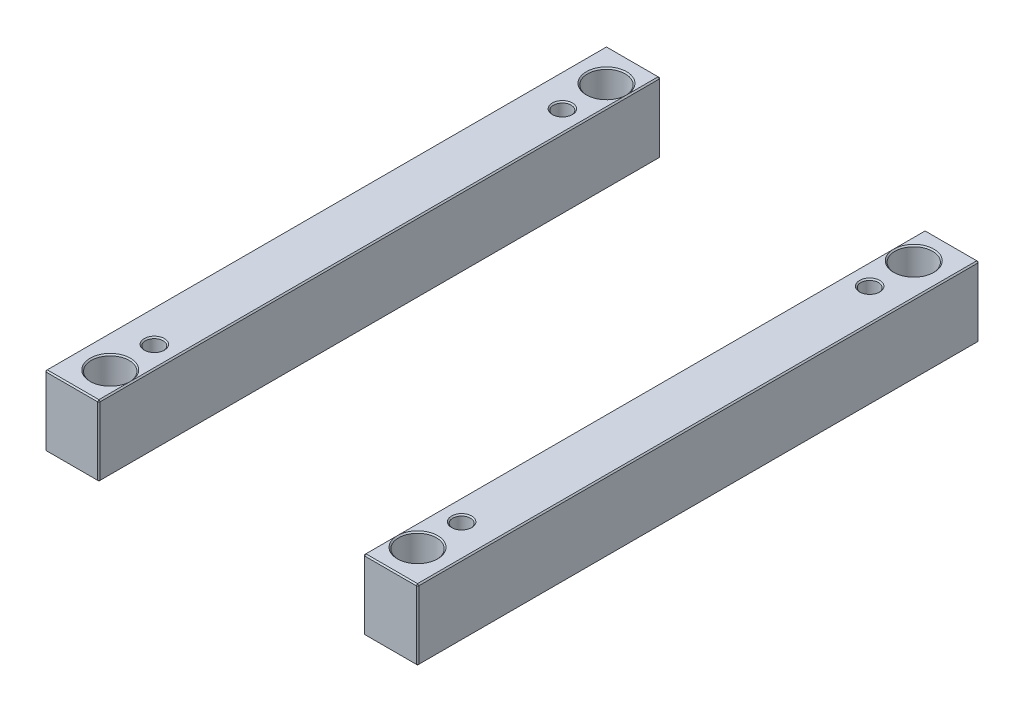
ISO-10303-21;
HEADER;
FILE_DESCRIPTION(('STEP AP214'),'2;1');
FILE_NAME('part.step','',(''),(''),'','','');
FILE_SCHEMA(('AUTOMOTIVE_DESIGN { 1 0 10303 214 1 1 1 1 }'));
ENDSEC;
DATA;
#1=APPLICATION_CONTEXT('core data for automotive mechanical design processes');
#2=APPLICATION_PROTOCOL_DEFINITION('international standard','automotive_design',2000,#1);
#3=PRODUCT_CONTEXT('',#1,'mechanical');
#4=PRODUCT('Part','Part','',(#3));
#5=PRODUCT_RELATED_PRODUCT_CATEGORY('part','',(#4));
#6=PRODUCT_DEFINITION_FORMATION('','',#4);
#7=PRODUCT_DEFINITION_CONTEXT('part definition',#1,'design');
#8=PRODUCT_DEFINITION('design','',#6,#7);
#9=PRODUCT_DEFINITION_SHAPE('','',#8);
#10=(LENGTH_UNIT() NAMED_UNIT(*) SI_UNIT(.MILLI.,.METRE.));
#11=(NAMED_UNIT(*) PLANE_ANGLE_UNIT() SI_UNIT($,.RADIAN.));
#12=(NAMED_UNIT(*) SI_UNIT($,.STERADIAN.) SOLID_ANGLE_UNIT());
#13=UNCERTAINTY_MEASURE_WITH_UNIT(LENGTH_MEASURE(1.E-05),#10,'distance_accuracy_value','');
#14=(GEOMETRIC_REPRESENTATION_CONTEXT(3) GLOBAL_UNCERTAINTY_ASSIGNED_CONTEXT((#13)) GLOBAL_UNIT_ASSIGNED_CONTEXT((#10,
#11,#12)) REPRESENTATION_CONTEXT('',''));
#15=CARTESIAN_POINT('',(0.,0.,0.));
#16=DIRECTION('',(0.,0.,1.));
#17=DIRECTION('',(1.,0.,0.));
#18=AXIS2_PLACEMENT_3D('',#15,#16,#17);
#19=CARTESIAN_POINT('',(-148.,56.,-223.));
#20=DIRECTION('',(0.,0.,1.));
#21=DIRECTION('',(1.,0.,0.));
#22=AXIS2_PLACEMENT_3D('',#19,#20,#21);
#23=PLANE('',#22);
#24=DIRECTION('',(-1.,0.,0.));
#25=VECTOR('',#24,1.);
#26=CARTESIAN_POINT('',(-148.,1.,-223.));
#27=LINE('',#26,#25);
#28=CARTESIAN_POINT('',(-106.,1.,-223.));
#29=VERTEX_POINT('',#28);
#30=CARTESIAN_POINT('',(-147.,1.,-223.));
#31=VERTEX_POINT('',#30);
#32=EDGE_CURVE('P0_E151',#29,#31,#27,.T.);
#33=ORIENTED_EDGE('',*,*,#32,.T.);
#34=DIRECTION('',(0.,1.,0.));
#35=VECTOR('',#34,1.);
#36=CARTESIAN_POINT('',(-147.,56.,-223.));
#37=LINE('',#36,#35);
#38=CARTESIAN_POINT('',(-147.,55.,-223.));
#39=VERTEX_POINT('',#38);
#40=EDGE_CURVE('P0_E266',#31,#39,#37,.T.);
#41=ORIENTED_EDGE('',*,*,#40,.T.);
#42=DIRECTION('',(1.,0.,0.));
#43=VECTOR('',#42,1.);
#44=CARTESIAN_POINT('',(-148.,55.,-223.));
#45=LINE('',#44,#43);
#46=CARTESIAN_POINT('',(-106.,55.,-223.));
#47=VERTEX_POINT('',#46);
#48=EDGE_CURVE('P0_E264',#39,#47,#45,.T.);
#49=ORIENTED_EDGE('',*,*,#48,.T.);
#50=DIRECTION('',(0.,-1.,0.));
#51=VECTOR('',#50,1.);
#52=CARTESIAN_POINT('',(-106.,56.,-223.));
#53=LINE('',#52,#51);
#54=EDGE_CURVE('P0_E261',#47,#29,#53,.T.);
#55=ORIENTED_EDGE('',*,*,#54,.T.);
#56=EDGE_LOOP('',(#33,#41,#49,#55));
#57=FACE_BOUND('',#56,.T.);
#58=ADVANCED_FACE('P0_F16',(#57),#23,.F.);
#59=CARTESIAN_POINT('',(-148.,56.,223.));
#60=DIRECTION('',(1.,0.,0.));
#61=DIRECTION('',(0.,0.,-1.));
#62=AXIS2_PLACEMENT_3D('',#59,#60,#61);
#63=PLANE('',#62);
#64=DIRECTION('',(0.,1.,0.));
#65=VECTOR('',#64,1.);
#66=CARTESIAN_POINT('',(-148.,56.,222.));
#67=LINE('',#66,#65);
#68=CARTESIAN_POINT('',(-148.,1.,222.));
#69=VERTEX_POINT('',#68);
#70=CARTESIAN_POINT('',(-148.,55.,222.));
#71=VERTEX_POINT('',#70);
#72=EDGE_CURVE('P0_E254',#69,#71,#67,.T.);
#73=ORIENTED_EDGE('',*,*,#72,.T.);
#74=DIRECTION('',(0.,0.,-1.));
#75=VECTOR('',#74,1.);
#76=CARTESIAN_POINT('',(-148.,55.,223.));
#77=LINE('',#76,#75);
#78=CARTESIAN_POINT('',(-148.,55.,-222.));
#79=VERTEX_POINT('',#78);
#80=EDGE_CURVE('P0_E259',#71,#79,#77,.T.);
#81=ORIENTED_EDGE('',*,*,#80,.T.);
#82=DIRECTION('',(0.,-1.,0.));
#83=VECTOR('',#82,1.);
#84=CARTESIAN_POINT('',(-148.,56.,-222.));
#85=LINE('',#84,#83);
#86=CARTESIAN_POINT('',(-148.,1.,-222.));
#87=VERTEX_POINT('',#86);
#88=EDGE_CURVE('P0_E256',#79,#87,#85,.T.);
#89=ORIENTED_EDGE('',*,*,#88,.T.);
#90=DIRECTION('',(0.,0.,1.));
#91=VECTOR('',#90,1.);
#92=CARTESIAN_POINT('',(-148.,1.,223.));
#93=LINE('',#92,#91);
#94=EDGE_CURVE('P0_E252',#87,#69,#93,.T.);
#95=ORIENTED_EDGE('',*,*,#94,.T.);
#96=EDGE_LOOP('',(#73,#81,#89,#95));
#97=FACE_BOUND('',#96,.T.);
#98=ADVANCED_FACE('P0_F340',(#97),#63,.F.);
#99=CARTESIAN_POINT('',(-148.,56.,223.));
#100=DIRECTION('',(0.,0.,-1.));
#101=DIRECTION('',(-1.,0.,0.));
#102=AXIS2_PLACEMENT_3D('',#99,#100,#101);
#103=PLANE('',#102);
#104=DIRECTION('',(-1.,0.,0.));
#105=VECTOR('',#104,1.);
#106=CARTESIAN_POINT('',(-148.,55.,223.));
#107=LINE('',#106,#105);
#108=CARTESIAN_POINT('',(-106.,55.,223.));
#109=VERTEX_POINT('',#108);
#110=CARTESIAN_POINT('',(-147.,55.,223.));
#111=VERTEX_POINT('',#110);
#112=EDGE_CURVE('P0_E273',#109,#111,#107,.T.);
#113=ORIENTED_EDGE('',*,*,#112,.T.);
#114=DIRECTION('',(0.,-1.,0.));
#115=VECTOR('',#114,1.);
#116=CARTESIAN_POINT('',(-147.,56.,223.));
#117=LINE('',#116,#115);
#118=CARTESIAN_POINT('',(-147.,1.,223.));
#119=VERTEX_POINT('',#118);
#120=EDGE_CURVE('P0_E275',#111,#119,#117,.T.);
#121=ORIENTED_EDGE('',*,*,#120,.T.);
#122=DIRECTION('',(1.,0.,0.));
#123=VECTOR('',#122,1.);
#124=CARTESIAN_POINT('',(-105.,1.,223.));
#125=LINE('',#124,#123);
#126=CARTESIAN_POINT('',(-106.,1.,223.));
#127=VERTEX_POINT('',#126);
#128=EDGE_CURVE('P0_E271',#119,#127,#125,.T.);
#129=ORIENTED_EDGE('',*,*,#128,.T.);
#130=DIRECTION('',(0.,1.,0.));
#131=VECTOR('',#130,1.);
#132=CARTESIAN_POINT('',(-106.,56.,223.));
#133=LINE('',#132,#131);
#134=EDGE_CURVE('P0_E269',#127,#109,#133,.T.);
#135=ORIENTED_EDGE('',*,*,#134,.T.);
#136=EDGE_LOOP('',(#113,#121,#129,#135));
#137=FACE_BOUND('',#136,.T.);
#138=ADVANCED_FACE('P0_F395',(#137),#103,.F.);
#139=CARTESIAN_POINT('',(-105.,56.,-223.));
#140=DIRECTION('',(-1.,0.,0.));
#141=DIRECTION('',(0.,0.,1.));
#142=AXIS2_PLACEMENT_3D('',#139,#140,#141);
#143=PLANE('',#142);
#144=DIRECTION('',(0.,0.,1.));
#145=VECTOR('',#144,1.);
#146=CARTESIAN_POINT('',(-105.,55.,-223.));
#147=LINE('',#146,#145);
#148=CARTESIAN_POINT('',(-105.,55.,-222.));
#149=VERTEX_POINT('',#148);
#150=CARTESIAN_POINT('',(-105.,55.,222.));
#151=VERTEX_POINT('',#150);
#152=EDGE_CURVE('P0_E294',#149,#151,#147,.T.);
#153=ORIENTED_EDGE('',*,*,#152,.T.);
#154=DIRECTION('',(0.,-1.,0.));
#155=VECTOR('',#154,1.);
#156=CARTESIAN_POINT('',(-105.,56.,222.));
#157=LINE('',#156,#155);
#158=CARTESIAN_POINT('',(-105.,1.,222.));
#159=VERTEX_POINT('',#158);
#160=EDGE_CURVE('P0_E206',#151,#159,#157,.T.);
#161=ORIENTED_EDGE('',*,*,#160,.T.);
#162=DIRECTION('',(0.,0.,-1.));
#163=VECTOR('',#162,1.);
#164=CARTESIAN_POINT('',(-105.,1.,-223.));
#165=LINE('',#164,#163);
#166=CARTESIAN_POINT('',(-105.,1.,-222.));
#167=VERTEX_POINT('',#166);
#168=EDGE_CURVE('P0_E290',#159,#167,#165,.T.);
#169=ORIENTED_EDGE('',*,*,#168,.T.);
#170=DIRECTION('',(0.,1.,0.));
#171=VECTOR('',#170,1.);
#172=CARTESIAN_POINT('',(-105.,56.,-222.));
#173=LINE('',#172,#171);
#174=EDGE_CURVE('P0_E292',#167,#149,#173,.T.);
#175=ORIENTED_EDGE('',*,*,#174,.T.);
#176=EDGE_LOOP('',(#153,#161,#169,#175));
#177=FACE_BOUND('',#176,.T.);
#178=ADVANCED_FACE('P0_F370',(#177),#143,.F.);
#179=CARTESIAN_POINT('',(0.,56.,0.));
#180=DIRECTION('',(0.,-1.,0.));
#181=DIRECTION('',(0.,0.,-1.));
#182=AXIS2_PLACEMENT_3D('',#179,#180,#181);
#183=PLANE('',#182);
#184=CARTESIAN_POINT('',(-122.,56.,162.));
#185=DIRECTION('',(0.,-1.,0.));
#186=DIRECTION('',(0.,0.,-1.));
#187=AXIS2_PLACEMENT_3D('',#184,#185,#186);
#188=CIRCLE('',#187,8.);
#189=CARTESIAN_POINT('',(-122.,56.,154.));
#190=VERTEX_POINT('',#189);
#191=EDGE_CURVE('P0_E209',#190,#190,#188,.T.);
#192=ORIENTED_EDGE('',*,*,#191,.T.);
#193=EDGE_LOOP('',(#192));
#194=FACE_BOUND('',#193,.T.);
#195=CARTESIAN_POINT('',(-122.,56.,-162.));
#196=DIRECTION('',(0.,-1.,0.));
#197=DIRECTION('',(0.,0.,-1.));
#198=AXIS2_PLACEMENT_3D('',#195,#196,#197);
#199=CIRCLE('',#198,8.);
#200=CARTESIAN_POINT('',(-122.,56.,-170.));
#201=VERTEX_POINT('',#200);
#202=EDGE_CURVE('P0_E205',#201,#201,#199,.T.);
#203=ORIENTED_EDGE('',*,*,#202,.T.);
#204=EDGE_LOOP('',(#203));
#205=FACE_BOUND('',#204,.T.);
#206=DIRECTION('',(0.,0.,-1.));
#207=VECTOR('',#206,1.);
#208=CARTESIAN_POINT('',(-106.,56.,0.));
#209=LINE('',#208,#207);
#210=CARTESIAN_POINT('',(-106.,56.,197.));
#211=VERTEX_POINT('',#210);
#212=CARTESIAN_POINT('',(-106.,56.,-197.));
#213=VERTEX_POINT('',#212);
#214=EDGE_CURVE('P0_E283',#211,#213,#209,.T.);
#215=ORIENTED_EDGE('',*,*,#214,.T.);
#216=CARTESIAN_POINT('',(-122.,56.,-197.));
#217=DIRECTION('',(0.,-1.,0.));
#218=DIRECTION('',(0.,0.,-1.));
#219=AXIS2_PLACEMENT_3D('',#216,#217,#218);
#220=CIRCLE('',#219,16.);
#221=EDGE_CURVE('P0_E29',#213,#213,#220,.T.);
#222=ORIENTED_EDGE('',*,*,#221,.T.);
#223=CARTESIAN_POINT('',(-106.,56.,-222.));
#224=VERTEX_POINT('',#223);
#225=EDGE_CURVE('P0_E278',#213,#224,#209,.T.);
#226=ORIENTED_EDGE('',*,*,#225,.T.);
#227=DIRECTION('',(-1.,0.,0.));
#228=VECTOR('',#227,1.);
#229=CARTESIAN_POINT('',(1.43296227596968E-13,56.,-222.));
#230=LINE('',#229,#228);
#231=CARTESIAN_POINT('',(-147.,56.,-222.));
#232=VERTEX_POINT('',#231);
#233=EDGE_CURVE('P0_E282',#224,#232,#230,.T.);
#234=ORIENTED_EDGE('',*,*,#233,.T.);
#235=DIRECTION('',(0.,0.,1.));
#236=VECTOR('',#235,1.);
#237=CARTESIAN_POINT('',(-147.,56.,0.));
#238=LINE('',#237,#236);
#239=CARTESIAN_POINT('',(-147.,56.,222.));
#240=VERTEX_POINT('',#239);
#241=EDGE_CURVE('P0_E285',#232,#240,#238,.T.);
#242=ORIENTED_EDGE('',*,*,#241,.T.);
#243=DIRECTION('',(1.,0.,0.));
#244=VECTOR('',#243,1.);
#245=CARTESIAN_POINT('',(-1.43296227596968E-13,56.,222.));
#246=LINE('',#245,#244);
#247=CARTESIAN_POINT('',(-106.,56.,222.));
#248=VERTEX_POINT('',#247);
#249=EDGE_CURVE('P0_E287',#240,#248,#246,.T.);
#250=ORIENTED_EDGE('',*,*,#249,.T.);
#251=EDGE_CURVE('P0_E279',#248,#211,#209,.T.);
#252=ORIENTED_EDGE('',*,*,#251,.T.);
#253=CARTESIAN_POINT('',(-122.,56.,197.));
#254=DIRECTION('',(0.,-1.,0.));
#255=DIRECTION('',(0.,0.,-1.));
#256=AXIS2_PLACEMENT_3D('',#253,#254,#255);
#257=CIRCLE('',#256,16.);
#258=EDGE_CURVE('P0_E34',#211,#211,#257,.T.);
#259=ORIENTED_EDGE('',*,*,#258,.T.);
#260=EDGE_LOOP('',(#215,#222,#226,#234,#242,#250,#252,#259));
#261=FACE_BOUND('',#260,.T.);
#262=ADVANCED_FACE('P0_F354',(#194,#205,#261),#183,.F.);
#263=CARTESIAN_POINT('',(0.,0.,0.));
#264=DIRECTION('',(0.,-1.,0.));
#265=DIRECTION('',(0.,0.,-1.));
#266=AXIS2_PLACEMENT_3D('',#263,#264,#265);
#267=PLANE('',#266);
#268=CARTESIAN_POINT('',(-122.,0.,-162.));
#269=DIRECTION('',(0.,-1.,0.));
#270=DIRECTION('',(0.,0.,-1.));
#271=AXIS2_PLACEMENT_3D('',#268,#269,#270);
#272=CIRCLE('',#271,8.);
#273=CARTESIAN_POINT('',(-122.,0.,-170.));
#274=VERTEX_POINT('',#273);
#275=EDGE_CURVE('P0_E243',#274,#274,#272,.F.);
#276=ORIENTED_EDGE('',*,*,#275,.T.);
#277=EDGE_LOOP('',(#276));
#278=FACE_BOUND('',#277,.T.);
#279=CARTESIAN_POINT('',(-122.,0.,162.));
#280=DIRECTION('',(0.,-1.,0.));
#281=DIRECTION('',(0.,0.,-1.));
#282=AXIS2_PLACEMENT_3D('',#279,#280,#281);
#283=CIRCLE('',#282,8.);
#284=CARTESIAN_POINT('',(-122.,0.,154.));
#285=VERTEX_POINT('',#284);
#286=EDGE_CURVE('P0_E240',#285,#285,#283,.F.);
#287=ORIENTED_EDGE('',*,*,#286,.T.);
#288=EDGE_LOOP('',(#287));
#289=FACE_BOUND('',#288,.T.);
#290=DIRECTION('',(0.,0.,1.));
#291=VECTOR('',#290,1.);
#292=CARTESIAN_POINT('',(-106.,0.,223.));
#293=LINE('',#292,#291);
#294=CARTESIAN_POINT('',(-106.,0.,-222.));
#295=VERTEX_POINT('',#294);
#296=CARTESIAN_POINT('',(-106.,0.,-197.));
#297=VERTEX_POINT('',#296);
#298=EDGE_CURVE('P0_E120',#295,#297,#293,.T.);
#299=ORIENTED_EDGE('',*,*,#298,.T.);
#300=CARTESIAN_POINT('',(-122.,0.,-197.));
#301=DIRECTION('',(0.,-1.,0.));
#302=DIRECTION('',(0.,0.,-1.));
#303=AXIS2_PLACEMENT_3D('',#300,#301,#302);
#304=CIRCLE('',#303,16.);
#305=EDGE_CURVE('P0_E218',#297,#297,#304,.F.);
#306=ORIENTED_EDGE('',*,*,#305,.T.);
#307=CARTESIAN_POINT('',(-106.,0.,197.));
#308=VERTEX_POINT('',#307);
#309=EDGE_CURVE('P0_E138',#297,#308,#293,.T.);
#310=ORIENTED_EDGE('',*,*,#309,.T.);
#311=CARTESIAN_POINT('',(-122.,0.,197.));
#312=DIRECTION('',(0.,-1.,0.));
#313=DIRECTION('',(0.,0.,-1.));
#314=AXIS2_PLACEMENT_3D('',#311,#312,#313);
#315=CIRCLE('',#314,16.);
#316=EDGE_CURVE('P0_E215',#308,#308,#315,.F.);
#317=ORIENTED_EDGE('',*,*,#316,.T.);
#318=CARTESIAN_POINT('',(-106.,0.,222.));
#319=VERTEX_POINT('',#318);
#320=EDGE_CURVE('P0_E140',#308,#319,#293,.T.);
#321=ORIENTED_EDGE('',*,*,#320,.T.);
#322=DIRECTION('',(-1.,0.,0.));
#323=VECTOR('',#322,1.);
#324=CARTESIAN_POINT('',(-148.,0.,222.));
#325=LINE('',#324,#323);
#326=CARTESIAN_POINT('',(-147.,0.,222.));
#327=VERTEX_POINT('',#326);
#328=EDGE_CURVE('P0_E126',#319,#327,#325,.T.);
#329=ORIENTED_EDGE('',*,*,#328,.T.);
#330=DIRECTION('',(0.,0.,-1.));
#331=VECTOR('',#330,1.);
#332=CARTESIAN_POINT('',(-147.,0.,-223.));
#333=LINE('',#332,#331);
#334=CARTESIAN_POINT('',(-147.,0.,-222.));
#335=VERTEX_POINT('',#334);
#336=EDGE_CURVE('P0_E122',#327,#335,#333,.T.);
#337=ORIENTED_EDGE('',*,*,#336,.T.);
#338=DIRECTION('',(1.,0.,0.));
#339=VECTOR('',#338,1.);
#340=CARTESIAN_POINT('',(-105.,0.,-222.));
#341=LINE('',#340,#339);
#342=EDGE_CURVE('P0_E116',#335,#295,#341,.T.);
#343=ORIENTED_EDGE('',*,*,#342,.T.);
#344=EDGE_LOOP('',(#299,#306,#310,#317,#321,#329,#337,#343));
#345=FACE_BOUND('',#344,.T.);
#346=ADVANCED_FACE('P0_F118',(#278,#289,#345),#267,.T.);
#347=CARTESIAN_POINT('',(-122.,0.,-162.));
#348=DIRECTION('',(0.,1.,0.));
#349=DIRECTION('',(0.,0.,1.));
#350=AXIS2_PLACEMENT_3D('',#347,#348,#349);
#351=CYLINDRICAL_SURFACE('',#350,7.);
#352=CARTESIAN_POINT('',(-122.,55.,-162.));
#353=DIRECTION('',(0.,-1.,0.));
#354=DIRECTION('',(0.,0.,-1.));
#355=AXIS2_PLACEMENT_3D('',#352,#353,#354);
#356=CIRCLE('',#355,7.);
#357=CARTESIAN_POINT('',(-122.,55.,-169.));
#358=VERTEX_POINT('',#357);
#359=EDGE_CURVE('P0_E212',#358,#358,#356,.F.);
#360=ORIENTED_EDGE('',*,*,#359,.T.);
#361=EDGE_LOOP('',(#360));
#362=FACE_BOUND('',#361,.T.);
#363=CARTESIAN_POINT('',(-122.,0.999999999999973,-162.));
#364=DIRECTION('',(0.,-1.,0.));
#365=DIRECTION('',(0.,0.,-1.));
#366=AXIS2_PLACEMENT_3D('',#363,#364,#365);
#367=CIRCLE('',#366,7.);
#368=CARTESIAN_POINT('',(-122.,0.999999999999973,-169.));
#369=VERTEX_POINT('',#368);
#370=EDGE_CURVE('P0_E246',#369,#369,#367,.T.);
#371=ORIENTED_EDGE('',*,*,#370,.T.);
#372=EDGE_LOOP('',(#371));
#373=FACE_BOUND('',#372,.T.);
#374=ADVANCED_FACE('P0_F445',(#362,#373),#351,.F.);
#375=CARTESIAN_POINT('',(-122.,0.,162.));
#376=DIRECTION('',(0.,1.,0.));
#377=DIRECTION('',(0.,0.,1.));
#378=AXIS2_PLACEMENT_3D('',#375,#376,#377);
#379=CYLINDRICAL_SURFACE('',#378,7.);
#380=CARTESIAN_POINT('',(-122.,55.,162.));
#381=DIRECTION('',(0.,-1.,0.));
#382=DIRECTION('',(0.,0.,-1.));
#383=AXIS2_PLACEMENT_3D('',#380,#381,#382);
#384=CIRCLE('',#383,7.);
#385=CARTESIAN_POINT('',(-122.,55.,155.));
#386=VERTEX_POINT('',#385);
#387=EDGE_CURVE('P0_E202',#386,#386,#384,.F.);
#388=ORIENTED_EDGE('',*,*,#387,.T.);
#389=EDGE_LOOP('',(#388));
#390=FACE_BOUND('',#389,.T.);
#391=CARTESIAN_POINT('',(-122.,0.999999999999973,162.));
#392=DIRECTION('',(0.,-1.,0.));
#393=DIRECTION('',(0.,0.,-1.));
#394=AXIS2_PLACEMENT_3D('',#391,#392,#393);
#395=CIRCLE('',#394,7.);
#396=CARTESIAN_POINT('',(-122.,0.999999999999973,155.));
#397=VERTEX_POINT('',#396);
#398=EDGE_CURVE('P0_E249',#397,#397,#395,.T.);
#399=ORIENTED_EDGE('',*,*,#398,.T.);
#400=EDGE_LOOP('',(#399));
#401=FACE_BOUND('',#400,.T.);
#402=ADVANCED_FACE('P0_F403',(#390,#401),#379,.F.);
#403=CARTESIAN_POINT('',(-122.,0.,-162.));
#404=DIRECTION('',(0.,-1.,0.));
#405=DIRECTION('',(0.,0.,-1.));
#406=AXIS2_PLACEMENT_3D('',#403,#404,#405);
#407=CONICAL_SURFACE('',#406,8.,0.785398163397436);
#408=ORIENTED_EDGE('',*,*,#370,.F.);
#409=EDGE_LOOP('',(#408));
#410=FACE_BOUND('',#409,.T.);
#411=ORIENTED_EDGE('',*,*,#275,.F.);
#412=EDGE_LOOP('',(#411));
#413=FACE_BOUND('',#412,.T.);
#414=ADVANCED_FACE('P0_F399',(#410,#413),#407,.F.);
#415=CARTESIAN_POINT('',(-122.,0.,162.));
#416=DIRECTION('',(0.,-1.,0.));
#417=DIRECTION('',(0.,0.,-1.));
#418=AXIS2_PLACEMENT_3D('',#415,#416,#417);
#419=CONICAL_SURFACE('',#418,8.,0.785398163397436);
#420=ORIENTED_EDGE('',*,*,#398,.F.);
#421=EDGE_LOOP('',(#420));
#422=FACE_BOUND('',#421,.T.);
#423=ORIENTED_EDGE('',*,*,#286,.F.);
#424=EDGE_LOOP('',(#423));
#425=FACE_BOUND('',#424,.T.);
#426=ADVANCED_FACE('P0_F402',(#422,#425),#419,.F.);
#427=CARTESIAN_POINT('',(-105.,56.,222.));
#428=DIRECTION('',(-0.707106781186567,0.,-0.707106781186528));
#429=DIRECTION('',(0.,-1.,0.));
#430=AXIS2_PLACEMENT_3D('',#427,#428,#429);
#431=PLANE('',#430);
#432=DIRECTION('',(-0.707106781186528,0.,0.707106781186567));
#433=VECTOR('',#432,1.);
#434=CARTESIAN_POINT('',(-105.5,55.,222.5));
#435=LINE('',#434,#433);
#436=EDGE_CURVE('P0_E199',#109,#151,#435,.F.);
#437=ORIENTED_EDGE('',*,*,#436,.F.);
#438=ORIENTED_EDGE('',*,*,#134,.F.);
#439=DIRECTION('',(0.707106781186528,0.,-0.707106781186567));
#440=VECTOR('',#439,1.);
#441=CARTESIAN_POINT('',(-106.,1.,223.));
#442=LINE('',#441,#440);
#443=EDGE_CURVE('P0_E196',#159,#127,#442,.F.);
#444=ORIENTED_EDGE('',*,*,#443,.F.);
#445=ORIENTED_EDGE('',*,*,#160,.F.);
#446=EDGE_LOOP('',(#437,#438,#444,#445));
#447=FACE_BOUND('',#446,.T.);
#448=ADVANCED_FACE('P0_F367',(#447),#431,.F.);
#449=CARTESIAN_POINT('',(-106.,56.,222.));
#450=DIRECTION('',(0.577350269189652,0.577350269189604,0.57735026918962));
#451=DIRECTION('',(0.707106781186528,0.,-0.707106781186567));
#452=AXIS2_PLACEMENT_3D('',#449,#450,#451);
#453=PLANE('',#452);
#454=DIRECTION('',(0.,0.707106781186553,-0.707106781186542));
#455=VECTOR('',#454,1.);
#456=CARTESIAN_POINT('',(-106.,56.,222.));
#457=LINE('',#456,#455);
#458=EDGE_CURVE('P0_E190',#109,#248,#457,.T.);
#459=ORIENTED_EDGE('',*,*,#458,.F.);
#460=ORIENTED_EDGE('',*,*,#436,.T.);
#461=DIRECTION('',(0.70710678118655,-0.707106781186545,0.));
#462=VECTOR('',#461,1.);
#463=CARTESIAN_POINT('',(-106.,56.,222.));
#464=LINE('',#463,#462);
#465=EDGE_CURVE('P0_E193',#248,#151,#464,.T.);
#466=ORIENTED_EDGE('',*,*,#465,.F.);
#467=EDGE_LOOP('',(#459,#460,#466));
#468=FACE_BOUND('',#467,.T.);
#469=ADVANCED_FACE('P0_F362',(#468),#453,.T.);
#470=CARTESIAN_POINT('',(-106.,1.,223.));
#471=DIRECTION('',(0.577350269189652,-0.577350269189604,0.57735026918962));
#472=DIRECTION('',(0.707106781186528,0.,-0.707106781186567));
#473=AXIS2_PLACEMENT_3D('',#470,#471,#472);
#474=PLANE('',#473);
#475=DIRECTION('',(0.70710678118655,0.707106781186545,0.));
#476=VECTOR('',#475,1.);
#477=CARTESIAN_POINT('',(-105.5,0.499999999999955,222.));
#478=LINE('',#477,#476);
#479=EDGE_CURVE('P0_E185',#159,#319,#478,.F.);
#480=ORIENTED_EDGE('',*,*,#479,.F.);
#481=ORIENTED_EDGE('',*,*,#443,.T.);
#482=DIRECTION('',(0.,-0.707106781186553,-0.707106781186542));
#483=VECTOR('',#482,1.);
#484=CARTESIAN_POINT('',(-106.,1.,223.));
#485=LINE('',#484,#483);
#486=EDGE_CURVE('P0_E187',#319,#127,#485,.F.);
#487=ORIENTED_EDGE('',*,*,#486,.F.);
#488=EDGE_LOOP('',(#480,#481,#487));
#489=FACE_BOUND('',#488,.T.);
#490=ADVANCED_FACE('P0_F492',(#489),#474,.T.);
#491=CARTESIAN_POINT('',(-106.,56.,0.));
#492=DIRECTION('',(-0.707106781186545,-0.70710678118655,0.));
#493=DIRECTION('',(0.,0.,-1.));
#494=AXIS2_PLACEMENT_3D('',#491,#492,#493);
#495=PLANE('',#494);
#496=ORIENTED_EDGE('',*,*,#465,.T.);
#497=ORIENTED_EDGE('',*,*,#152,.F.);
#498=DIRECTION('',(-0.70710678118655,0.707106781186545,0.));
#499=VECTOR('',#498,1.);
#500=CARTESIAN_POINT('',(-105.5,55.5,-222.));
#501=LINE('',#500,#499);
#502=EDGE_CURVE('P0_E179',#224,#149,#501,.F.);
#503=ORIENTED_EDGE('',*,*,#502,.F.);
#504=ORIENTED_EDGE('',*,*,#225,.F.);
#505=ORIENTED_EDGE('',*,*,#214,.F.);
#506=ORIENTED_EDGE('',*,*,#251,.F.);
#507=EDGE_LOOP('',(#496,#497,#503,#504,#505,#506));
#508=FACE_BOUND('',#507,.T.);
#509=ADVANCED_FACE('P0_F358',(#508),#495,.F.);
#510=CARTESIAN_POINT('',(-1.43296227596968E-13,56.,222.));
#511=DIRECTION('',(0.,-0.707106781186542,-0.707106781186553));
#512=DIRECTION('',(1.,0.,0.));
#513=AXIS2_PLACEMENT_3D('',#510,#511,#512);
#514=PLANE('',#513);
#515=ORIENTED_EDGE('',*,*,#458,.T.);
#516=ORIENTED_EDGE('',*,*,#249,.F.);
#517=DIRECTION('',(0.,-0.707106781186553,0.707106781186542));
#518=VECTOR('',#517,1.);
#519=CARTESIAN_POINT('',(-147.,55.5,222.5));
#520=LINE('',#519,#518);
#521=EDGE_CURVE('P0_E176',#111,#240,#520,.F.);
#522=ORIENTED_EDGE('',*,*,#521,.F.);
#523=ORIENTED_EDGE('',*,*,#112,.F.);
#524=EDGE_LOOP('',(#515,#516,#522,#523));
#525=FACE_BOUND('',#524,.T.);
#526=ADVANCED_FACE('P0_F351',(#525),#514,.F.);
#527=CARTESIAN_POINT('',(-147.,56.,223.));
#528=DIRECTION('',(0.707106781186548,0.,-0.707106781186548));
#529=DIRECTION('',(0.,-1.,0.));
#530=AXIS2_PLACEMENT_3D('',#527,#528,#529);
#531=PLANE('',#530);
#532=DIRECTION('',(0.707106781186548,0.,0.707106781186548));
#533=VECTOR('',#532,1.);
#534=CARTESIAN_POINT('',(-147.,1.,223.));
#535=LINE('',#534,#533);
#536=EDGE_CURVE('P0_E170',#119,#69,#535,.F.);
#537=ORIENTED_EDGE('',*,*,#536,.F.);
#538=ORIENTED_EDGE('',*,*,#120,.F.);
#539=DIRECTION('',(-0.707106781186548,0.,-0.707106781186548));
#540=VECTOR('',#539,1.);
#541=CARTESIAN_POINT('',(-148.,55.,222.));
#542=LINE('',#541,#540);
#543=EDGE_CURVE('P0_E173',#71,#111,#542,.F.);
#544=ORIENTED_EDGE('',*,*,#543,.F.);
#545=ORIENTED_EDGE('',*,*,#72,.F.);
#546=EDGE_LOOP('',(#537,#538,#544,#545));
#547=FACE_BOUND('',#546,.T.);
#548=ADVANCED_FACE('P0_F345',(#547),#531,.F.);
#549=CARTESIAN_POINT('',(-148.,1.,223.));
#550=DIRECTION('',(0.,-0.707106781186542,0.707106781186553));
#551=DIRECTION('',(-1.,0.,0.));
#552=AXIS2_PLACEMENT_3D('',#549,#550,#551);
#553=PLANE('',#552);
#554=ORIENTED_EDGE('',*,*,#486,.T.);
#555=ORIENTED_EDGE('',*,*,#128,.F.);
#556=DIRECTION('',(0.,0.707106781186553,0.707106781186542));
#557=VECTOR('',#556,1.);
#558=CARTESIAN_POINT('',(-147.,1.,223.));
#559=LINE('',#558,#557);
#560=EDGE_CURVE('P0_E148',#327,#119,#559,.T.);
#561=ORIENTED_EDGE('',*,*,#560,.F.);
#562=ORIENTED_EDGE('',*,*,#328,.F.);
#563=EDGE_LOOP('',(#554,#555,#561,#562));
#564=FACE_BOUND('',#563,.T.);
#565=ADVANCED_FACE('P0_F434',(#564),#553,.T.);
#566=CARTESIAN_POINT('',(-105.,1.,-223.));
#567=DIRECTION('',(0.707106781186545,-0.70710678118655,0.));
#568=DIRECTION('',(0.,0.,1.));
#569=AXIS2_PLACEMENT_3D('',#566,#567,#568);
#570=PLANE('',#569);
#571=ORIENTED_EDGE('',*,*,#479,.T.);
#572=ORIENTED_EDGE('',*,*,#320,.F.);
#573=ORIENTED_EDGE('',*,*,#309,.F.);
#574=ORIENTED_EDGE('',*,*,#298,.F.);
#575=DIRECTION('',(-0.70710678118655,-0.707106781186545,0.));
#576=VECTOR('',#575,1.);
#577=CARTESIAN_POINT('',(-106.,0.,-222.));
#578=LINE('',#577,#576);
#579=EDGE_CURVE('P0_E134',#167,#295,#578,.T.);
#580=ORIENTED_EDGE('',*,*,#579,.F.);
#581=ORIENTED_EDGE('',*,*,#168,.F.);
#582=EDGE_LOOP('',(#571,#572,#573,#574,#580,#581));
#583=FACE_BOUND('',#582,.T.);
#584=ADVANCED_FACE('P0_F133',(#583),#570,.T.);
#585=CARTESIAN_POINT('',(-106.,56.,-223.));
#586=DIRECTION('',(-0.707106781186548,0.,0.707106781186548));
#587=DIRECTION('',(0.,-1.,0.));
#588=AXIS2_PLACEMENT_3D('',#585,#586,#587);
#589=PLANE('',#588);
#590=DIRECTION('',(0.707106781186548,0.,0.707106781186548));
#591=VECTOR('',#590,1.);
#592=CARTESIAN_POINT('',(-106.,55.,-223.));
#593=LINE('',#592,#591);
#594=EDGE_CURVE('P0_E182',#149,#47,#593,.F.);
#595=ORIENTED_EDGE('',*,*,#594,.F.);
#596=ORIENTED_EDGE('',*,*,#174,.F.);
#597=DIRECTION('',(-0.707106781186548,0.,-0.707106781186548));
#598=VECTOR('',#597,1.);
#599=CARTESIAN_POINT('',(-105.5,1.,-222.5));
#600=LINE('',#599,#598);
#601=EDGE_CURVE('P0_E147',#29,#167,#600,.F.);
#602=ORIENTED_EDGE('',*,*,#601,.F.);
#603=ORIENTED_EDGE('',*,*,#54,.F.);
#604=EDGE_LOOP('',(#595,#596,#602,#603));
#605=FACE_BOUND('',#604,.T.);
#606=ADVANCED_FACE('P0_F375',(#605),#589,.F.);
#607=CARTESIAN_POINT('',(-106.,55.,-223.));
#608=DIRECTION('',(0.577350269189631,0.577350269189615,-0.577350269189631));
#609=DIRECTION('',(-0.707106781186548,0.,-0.707106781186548));
#610=AXIS2_PLACEMENT_3D('',#607,#608,#609);
#611=PLANE('',#610);
#612=ORIENTED_EDGE('',*,*,#502,.T.);
#613=ORIENTED_EDGE('',*,*,#594,.T.);
#614=DIRECTION('',(0.,-0.707106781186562,-0.707106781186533));
#615=VECTOR('',#614,1.);
#616=CARTESIAN_POINT('',(-106.,55.,-223.));
#617=LINE('',#616,#615);
#618=EDGE_CURVE('P0_E165',#224,#47,#617,.T.);
#619=ORIENTED_EDGE('',*,*,#618,.F.);
#620=EDGE_LOOP('',(#612,#613,#619));
#621=FACE_BOUND('',#620,.T.);
#622=ADVANCED_FACE('P0_F377',(#621),#611,.T.);
#623=CARTESIAN_POINT('',(-148.,55.,222.));
#624=DIRECTION('',(-0.577350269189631,0.577350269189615,0.577350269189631));
#625=DIRECTION('',(0.707106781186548,0.,0.707106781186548));
#626=AXIS2_PLACEMENT_3D('',#623,#624,#625);
#627=PLANE('',#626);
#628=ORIENTED_EDGE('',*,*,#543,.T.);
#629=ORIENTED_EDGE('',*,*,#521,.T.);
#630=DIRECTION('',(0.707106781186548,0.707106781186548,0.));
#631=VECTOR('',#630,1.);
#632=CARTESIAN_POINT('',(-148.,55.,222.));
#633=LINE('',#632,#631);
#634=EDGE_CURVE('P0_E156',#71,#240,#633,.T.);
#635=ORIENTED_EDGE('',*,*,#634,.F.);
#636=EDGE_LOOP('',(#628,#629,#635));
#637=FACE_BOUND('',#636,.T.);
#638=ADVANCED_FACE('P0_F348',(#637),#627,.T.);
#639=CARTESIAN_POINT('',(-147.,1.,223.));
#640=DIRECTION('',(-0.577350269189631,-0.577350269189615,0.577350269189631));
#641=DIRECTION('',(0.707106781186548,0.,0.707106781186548));
#642=AXIS2_PLACEMENT_3D('',#639,#640,#641);
#643=PLANE('',#642);
#644=ORIENTED_EDGE('',*,*,#560,.T.);
#645=ORIENTED_EDGE('',*,*,#536,.T.);
#646=DIRECTION('',(0.707106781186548,-0.707106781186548,0.));
#647=VECTOR('',#646,1.);
#648=CARTESIAN_POINT('',(-147.5,0.499999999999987,222.));
#649=LINE('',#648,#647);
#650=EDGE_CURVE('P0_E152',#327,#69,#649,.F.);
#651=ORIENTED_EDGE('',*,*,#650,.F.);
#652=EDGE_LOOP('',(#644,#645,#651));
#653=FACE_BOUND('',#652,.T.);
#654=ADVANCED_FACE('P0_F386',(#653),#643,.T.);
#655=CARTESIAN_POINT('',(-106.,0.,-222.));
#656=DIRECTION('',(0.577350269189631,-0.577350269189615,-0.577350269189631));
#657=DIRECTION('',(-0.707106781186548,0.,-0.707106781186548));
#658=AXIS2_PLACEMENT_3D('',#655,#656,#657);
#659=PLANE('',#658);
#660=ORIENTED_EDGE('',*,*,#601,.T.);
#661=ORIENTED_EDGE('',*,*,#579,.T.);
#662=DIRECTION('',(0.,0.707106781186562,-0.707106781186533));
#663=VECTOR('',#662,1.);
#664=CARTESIAN_POINT('',(-106.,0.,-222.));
#665=LINE('',#664,#663);
#666=EDGE_CURVE('P0_E144',#29,#295,#665,.F.);
#667=ORIENTED_EDGE('',*,*,#666,.F.);
#668=EDGE_LOOP('',(#660,#661,#667));
#669=FACE_BOUND('',#668,.T.);
#670=ADVANCED_FACE('P0_F143',(#669),#659,.T.);
#671=CARTESIAN_POINT('',(1.43296227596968E-13,56.,-222.));
#672=DIRECTION('',(0.,-0.707106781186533,0.707106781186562));
#673=DIRECTION('',(-1.,0.,0.));
#674=AXIS2_PLACEMENT_3D('',#671,#672,#673);
#675=PLANE('',#674);
#676=ORIENTED_EDGE('',*,*,#618,.T.);
#677=ORIENTED_EDGE('',*,*,#48,.F.);
#678=DIRECTION('',(0.,0.707106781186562,0.707106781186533));
#679=VECTOR('',#678,1.);
#680=CARTESIAN_POINT('',(-147.,55.,-223.));
#681=LINE('',#680,#679);
#682=EDGE_CURVE('P0_E153',#232,#39,#681,.F.);
#683=ORIENTED_EDGE('',*,*,#682,.F.);
#684=ORIENTED_EDGE('',*,*,#233,.F.);
#685=EDGE_LOOP('',(#676,#677,#683,#684));
#686=FACE_BOUND('',#685,.T.);
#687=ADVANCED_FACE('P0_F323',(#686),#675,.F.);
#688=CARTESIAN_POINT('',(-147.,56.,0.));
#689=DIRECTION('',(0.707106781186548,-0.707106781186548,0.));
#690=DIRECTION('',(0.,0.,1.));
#691=AXIS2_PLACEMENT_3D('',#688,#689,#690);
#692=PLANE('',#691);
#693=ORIENTED_EDGE('',*,*,#634,.T.);
#694=ORIENTED_EDGE('',*,*,#241,.F.);
#695=DIRECTION('',(-0.707106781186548,-0.707106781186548,0.));
#696=VECTOR('',#695,1.);
#697=CARTESIAN_POINT('',(-147.5,55.5,-222.));
#698=LINE('',#697,#696);
#699=EDGE_CURVE('P0_E159',#79,#232,#698,.F.);
#700=ORIENTED_EDGE('',*,*,#699,.F.);
#701=ORIENTED_EDGE('',*,*,#80,.F.);
#702=EDGE_LOOP('',(#693,#694,#700,#701));
#703=FACE_BOUND('',#702,.T.);
#704=ADVANCED_FACE('P0_F317',(#703),#692,.F.);
#705=CARTESIAN_POINT('',(-148.,1.,223.));
#706=DIRECTION('',(-0.707106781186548,-0.707106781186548,0.));
#707=DIRECTION('',(0.,0.,-1.));
#708=AXIS2_PLACEMENT_3D('',#705,#706,#707);
#709=PLANE('',#708);
#710=ORIENTED_EDGE('',*,*,#650,.T.);
#711=ORIENTED_EDGE('',*,*,#94,.F.);
#712=DIRECTION('',(-0.707106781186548,0.707106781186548,0.));
#713=VECTOR('',#712,1.);
#714=CARTESIAN_POINT('',(-148.,1.,-222.));
#715=LINE('',#714,#713);
#716=EDGE_CURVE('P0_E304',#335,#87,#715,.T.);
#717=ORIENTED_EDGE('',*,*,#716,.F.);
#718=ORIENTED_EDGE('',*,*,#336,.F.);
#719=EDGE_LOOP('',(#710,#711,#717,#718));
#720=FACE_BOUND('',#719,.T.);
#721=ADVANCED_FACE('P0_F336',(#720),#709,.T.);
#722=CARTESIAN_POINT('',(-148.,1.,-223.));
#723=DIRECTION('',(0.,-0.707106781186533,-0.707106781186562));
#724=DIRECTION('',(1.,0.,0.));
#725=AXIS2_PLACEMENT_3D('',#722,#723,#724);
#726=PLANE('',#725);
#727=ORIENTED_EDGE('',*,*,#666,.T.);
#728=ORIENTED_EDGE('',*,*,#342,.F.);
#729=DIRECTION('',(0.,-0.707106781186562,0.707106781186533));
#730=VECTOR('',#729,1.);
#731=CARTESIAN_POINT('',(-147.,0.500000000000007,-222.5));
#732=LINE('',#731,#730);
#733=EDGE_CURVE('P0_E302',#31,#335,#732,.T.);
#734=ORIENTED_EDGE('',*,*,#733,.F.);
#735=ORIENTED_EDGE('',*,*,#32,.F.);
#736=EDGE_LOOP('',(#727,#728,#734,#735));
#737=FACE_BOUND('',#736,.T.);
#738=ADVANCED_FACE('P0_F150',(#737),#726,.T.);
#739=CARTESIAN_POINT('',(-147.,55.,-223.));
#740=DIRECTION('',(-0.577350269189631,0.577350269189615,-0.577350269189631));
#741=DIRECTION('',(-0.707106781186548,0.,0.707106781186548));
#742=AXIS2_PLACEMENT_3D('',#739,#740,#741);
#743=PLANE('',#742);
#744=ORIENTED_EDGE('',*,*,#699,.T.);
#745=ORIENTED_EDGE('',*,*,#682,.T.);
#746=DIRECTION('',(0.707106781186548,0.,-0.707106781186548));
#747=VECTOR('',#746,1.);
#748=CARTESIAN_POINT('',(-147.,55.,-223.));
#749=LINE('',#748,#747);
#750=EDGE_CURVE('P0_E300',#79,#39,#749,.T.);
#751=ORIENTED_EDGE('',*,*,#750,.F.);
#752=EDGE_LOOP('',(#744,#745,#751));
#753=FACE_BOUND('',#752,.T.);
#754=ADVANCED_FACE('P0_F310',(#753),#743,.T.);
#755=CARTESIAN_POINT('',(-148.,1.,-222.));
#756=DIRECTION('',(-0.577350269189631,-0.577350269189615,-0.577350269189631));
#757=DIRECTION('',(-0.707106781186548,0.,0.707106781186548));
#758=AXIS2_PLACEMENT_3D('',#755,#756,#757);
#759=PLANE('',#758);
#760=ORIENTED_EDGE('',*,*,#733,.T.);
#761=ORIENTED_EDGE('',*,*,#716,.T.);
#762=DIRECTION('',(-0.707106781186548,0.,0.707106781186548));
#763=VECTOR('',#762,1.);
#764=CARTESIAN_POINT('',(-148.,1.,-222.));
#765=LINE('',#764,#763);
#766=EDGE_CURVE('P0_E298',#31,#87,#765,.T.);
#767=ORIENTED_EDGE('',*,*,#766,.F.);
#768=EDGE_LOOP('',(#760,#761,#767));
#769=FACE_BOUND('',#768,.T.);
#770=ADVANCED_FACE('P0_F332',(#769),#759,.T.);
#771=CARTESIAN_POINT('',(-148.,56.,-222.));
#772=DIRECTION('',(0.707106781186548,0.,0.707106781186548));
#773=DIRECTION('',(0.,-1.,0.));
#774=AXIS2_PLACEMENT_3D('',#771,#772,#773);
#775=PLANE('',#774);
#776=ORIENTED_EDGE('',*,*,#750,.T.);
#777=ORIENTED_EDGE('',*,*,#40,.F.);
#778=ORIENTED_EDGE('',*,*,#766,.T.);
#779=ORIENTED_EDGE('',*,*,#88,.F.);
#780=EDGE_LOOP('',(#776,#777,#778,#779));
#781=FACE_BOUND('',#780,.T.);
#782=ADVANCED_FACE('P0_F330',(#781),#775,.F.);
#783=CARTESIAN_POINT('',(-122.,55.,162.));
#784=DIRECTION('',(0.,1.,0.));
#785=DIRECTION('',(0.,0.,1.));
#786=AXIS2_PLACEMENT_3D('',#783,#784,#785);
#787=CONICAL_SURFACE('',#786,7.,0.785398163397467);
#788=ORIENTED_EDGE('',*,*,#191,.F.);
#789=EDGE_LOOP('',(#788));
#790=FACE_BOUND('',#789,.T.);
#791=ORIENTED_EDGE('',*,*,#387,.F.);
#792=EDGE_LOOP('',(#791));
#793=FACE_BOUND('',#792,.T.);
#794=ADVANCED_FACE('P0_F410',(#790,#793),#787,.F.);
#795=CARTESIAN_POINT('',(-122.,55.,-162.));
#796=DIRECTION('',(0.,1.,0.));
#797=DIRECTION('',(0.,0.,1.));
#798=AXIS2_PLACEMENT_3D('',#795,#796,#797);
#799=CONICAL_SURFACE('',#798,7.,0.785398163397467);
#800=ORIENTED_EDGE('',*,*,#202,.F.);
#801=EDGE_LOOP('',(#800));
#802=FACE_BOUND('',#801,.T.);
#803=ORIENTED_EDGE('',*,*,#359,.F.);
#804=EDGE_LOOP('',(#803));
#805=FACE_BOUND('',#804,.T.);
#806=ADVANCED_FACE('P0_F459',(#802,#805),#799,.F.);
#807=CARTESIAN_POINT('',(-122.,0.,197.));
#808=DIRECTION('',(0.,1.,0.));
#809=DIRECTION('',(0.,0.,1.));
#810=AXIS2_PLACEMENT_3D('',#807,#808,#809);
#811=CYLINDRICAL_SURFACE('',#810,15.);
#812=CARTESIAN_POINT('',(-122.,55.,197.));
#813=DIRECTION('',(0.,-1.,0.));
#814=DIRECTION('',(0.,0.,-1.));
#815=AXIS2_PLACEMENT_3D('',#812,#813,#814);
#816=CIRCLE('',#815,15.);
#817=CARTESIAN_POINT('',(-122.,55.,182.));
#818=VERTEX_POINT('',#817);
#819=EDGE_CURVE('P0_E10',#818,#818,#816,.F.);
#820=ORIENTED_EDGE('',*,*,#819,.T.);
#821=EDGE_LOOP('',(#820));
#822=FACE_BOUND('',#821,.T.);
#823=CARTESIAN_POINT('',(-122.,1.,197.));
#824=DIRECTION('',(0.,-1.,0.));
#825=DIRECTION('',(0.,0.,-1.));
#826=AXIS2_PLACEMENT_3D('',#823,#824,#825);
#827=CIRCLE('',#826,15.);
#828=CARTESIAN_POINT('',(-122.,1.,182.));
#829=VERTEX_POINT('',#828);
#830=EDGE_CURVE('P0_E24',#829,#829,#827,.T.);
#831=ORIENTED_EDGE('',*,*,#830,.T.);
#832=EDGE_LOOP('',(#831));
#833=FACE_BOUND('',#832,.T.);
#834=ADVANCED_FACE('P0_F230',(#822,#833),#811,.F.);
#835=CARTESIAN_POINT('',(-122.,0.,-197.));
#836=DIRECTION('',(0.,1.,0.));
#837=DIRECTION('',(0.,0.,1.));
#838=AXIS2_PLACEMENT_3D('',#835,#836,#837);
#839=CYLINDRICAL_SURFACE('',#838,15.);
#840=CARTESIAN_POINT('',(-122.,1.,-197.));
#841=DIRECTION('',(0.,-1.,0.));
#842=DIRECTION('',(0.,0.,-1.));
#843=AXIS2_PLACEMENT_3D('',#840,#841,#842);
#844=CIRCLE('',#843,15.);
#845=CARTESIAN_POINT('',(-122.,1.,-212.));
#846=VERTEX_POINT('',#845);
#847=EDGE_CURVE('P0_E223',#846,#846,#844,.T.);
#848=ORIENTED_EDGE('',*,*,#847,.T.);
#849=EDGE_LOOP('',(#848));
#850=FACE_BOUND('',#849,.T.);
#851=CARTESIAN_POINT('',(-122.,55.,-197.));
#852=DIRECTION('',(0.,-1.,0.));
#853=DIRECTION('',(0.,0.,-1.));
#854=AXIS2_PLACEMENT_3D('',#851,#852,#853);
#855=CIRCLE('',#854,15.);
#856=CARTESIAN_POINT('',(-122.,55.,-212.));
#857=VERTEX_POINT('',#856);
#858=EDGE_CURVE('P0_E220',#857,#857,#855,.F.);
#859=ORIENTED_EDGE('',*,*,#858,.T.);
#860=EDGE_LOOP('',(#859));
#861=FACE_BOUND('',#860,.T.);
#862=ADVANCED_FACE('P0_F458',(#850,#861),#839,.F.);
#863=CARTESIAN_POINT('',(-122.,0.,-197.));
#864=DIRECTION('',(0.,-1.,0.));
#865=DIRECTION('',(0.,0.,-1.));
#866=AXIS2_PLACEMENT_3D('',#863,#864,#865);
#867=CONICAL_SURFACE('',#866,16.,0.78539816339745);
#868=ORIENTED_EDGE('',*,*,#847,.F.);
#869=EDGE_LOOP('',(#868));
#870=FACE_BOUND('',#869,.T.);
#871=ORIENTED_EDGE('',*,*,#305,.F.);
#872=EDGE_LOOP('',(#871));
#873=FACE_BOUND('',#872,.T.);
#874=ADVANCED_FACE('P0_F462',(#870,#873),#867,.F.);
#875=CARTESIAN_POINT('',(-122.,55.,-197.));
#876=DIRECTION('',(0.,1.,0.));
#877=DIRECTION('',(0.,0.,1.));
#878=AXIS2_PLACEMENT_3D('',#875,#876,#877);
#879=CONICAL_SURFACE('',#878,15.,0.785398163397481);
#880=ORIENTED_EDGE('',*,*,#221,.F.);
#881=EDGE_LOOP('',(#880));
#882=FACE_BOUND('',#881,.T.);
#883=ORIENTED_EDGE('',*,*,#858,.F.);
#884=EDGE_LOOP('',(#883));
#885=FACE_BOUND('',#884,.T.);
#886=ADVANCED_FACE('P0_F468',(#882,#885),#879,.F.);
#887=CARTESIAN_POINT('',(-122.,55.,197.));
#888=DIRECTION('',(0.,1.,0.));
#889=DIRECTION('',(0.,0.,1.));
#890=AXIS2_PLACEMENT_3D('',#887,#888,#889);
#891=CONICAL_SURFACE('',#890,15.,0.785398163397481);
#892=ORIENTED_EDGE('',*,*,#258,.F.);
#893=EDGE_LOOP('',(#892));
#894=FACE_BOUND('',#893,.T.);
#895=ORIENTED_EDGE('',*,*,#819,.F.);
#896=EDGE_LOOP('',(#895));
#897=FACE_BOUND('',#896,.T.);
#898=ADVANCED_FACE('P0_F234',(#894,#897),#891,.F.);
#899=CARTESIAN_POINT('',(-122.,0.,197.));
#900=DIRECTION('',(0.,-1.,0.));
#901=DIRECTION('',(0.,0.,-1.));
#902=AXIS2_PLACEMENT_3D('',#899,#900,#901);
#903=CONICAL_SURFACE('',#902,16.,0.78539816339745);
#904=ORIENTED_EDGE('',*,*,#830,.F.);
#905=EDGE_LOOP('',(#904));
#906=FACE_BOUND('',#905,.T.);
#907=ORIENTED_EDGE('',*,*,#316,.F.);
#908=EDGE_LOOP('',(#907));
#909=FACE_BOUND('',#908,.T.);
#910=ADVANCED_FACE('P0_F18',(#906,#909),#903,.F.);
#911=CLOSED_SHELL('',(#58,#98,#138,#178,#262,#346,#374,#402,#414,#426,#448,#469,#490,#509,#526,
#548,#565,#584,#606,#622,#638,#654,#670,#687,#704,#721,#738,#754,#770,#782,#794,#806,#834,#862,
#874,#886,#898,#910));
#912=MANIFOLD_SOLID_BREP('P0_B1',#911);
#913=CARTESIAN_POINT('',(148.,56.,223.));
#914=DIRECTION('',(0.,0.,-1.));
#915=DIRECTION('',(-1.,0.,0.));
#916=AXIS2_PLACEMENT_3D('',#913,#914,#915);
#917=PLANE('',#916);
#918=DIRECTION('',(0.,-1.,0.));
#919=VECTOR('',#918,1.);
#920=CARTESIAN_POINT('',(106.,56.,223.));
#921=LINE('',#920,#919);
#922=CARTESIAN_POINT('',(106.,55.,223.));
#923=VERTEX_POINT('',#922);
#924=CARTESIAN_POINT('',(106.,1.,223.));
#925=VERTEX_POINT('',#924);
#926=EDGE_CURVE('P1_E188',#923,#925,#921,.T.);
#927=ORIENTED_EDGE('',*,*,#926,.T.);
#928=DIRECTION('',(1.,0.,0.));
#929=VECTOR('',#928,1.);
#930=CARTESIAN_POINT('',(148.,1.,223.));
#931=LINE('',#930,#929);
#932=CARTESIAN_POINT('',(147.,1.,223.));
#933=VERTEX_POINT('',#932);
#934=EDGE_CURVE('P1_E190',#925,#933,#931,.T.);
#935=ORIENTED_EDGE('',*,*,#934,.T.);
#936=DIRECTION('',(0.,1.,0.));
#937=VECTOR('',#936,1.);
#938=CARTESIAN_POINT('',(147.,56.,223.));
#939=LINE('',#938,#937);
#940=CARTESIAN_POINT('',(147.,55.,223.));
#941=VERTEX_POINT('',#940);
#942=EDGE_CURVE('P1_E186',#933,#941,#939,.T.);
#943=ORIENTED_EDGE('',*,*,#942,.T.);
#944=DIRECTION('',(-1.,0.,0.));
#945=VECTOR('',#944,1.);
#946=CARTESIAN_POINT('',(105.,55.,223.));
#947=LINE('',#946,#945);
#948=EDGE_CURVE('P1_E184',#941,#923,#947,.T.);
#949=ORIENTED_EDGE('',*,*,#948,.T.);
#950=EDGE_LOOP('',(#927,#935,#943,#949));
#951=FACE_BOUND('',#950,.T.);
#952=ADVANCED_FACE('P1_F16',(#951),#917,.F.);
#953=CARTESIAN_POINT('',(148.,56.,223.));
#954=DIRECTION('',(-1.,0.,0.));
#955=DIRECTION('',(0.,0.,1.));
#956=AXIS2_PLACEMENT_3D('',#953,#954,#955);
#957=PLANE('',#956);
#958=DIRECTION('',(0.,0.,1.));
#959=VECTOR('',#958,1.);
#960=CARTESIAN_POINT('',(148.,55.,223.));
#961=LINE('',#960,#959);
#962=CARTESIAN_POINT('',(148.,55.,-222.));
#963=VERTEX_POINT('',#962);
#964=CARTESIAN_POINT('',(148.,55.,222.));
#965=VERTEX_POINT('',#964);
#966=EDGE_CURVE('P1_E202',#963,#965,#961,.T.);
#967=ORIENTED_EDGE('',*,*,#966,.T.);
#968=DIRECTION('',(0.,-1.,0.));
#969=VECTOR('',#968,1.);
#970=CARTESIAN_POINT('',(148.,56.,222.));
#971=LINE('',#970,#969);
#972=CARTESIAN_POINT('',(148.,1.,222.));
#973=VERTEX_POINT('',#972);
#974=EDGE_CURVE('P1_E208',#965,#973,#971,.T.);
#975=ORIENTED_EDGE('',*,*,#974,.T.);
#976=DIRECTION('',(0.,0.,-1.));
#977=VECTOR('',#976,1.);
#978=CARTESIAN_POINT('',(148.,1.,223.));
#979=LINE('',#978,#977);
#980=CARTESIAN_POINT('',(148.,1.,-222.));
#981=VERTEX_POINT('',#980);
#982=EDGE_CURVE('P1_E206',#973,#981,#979,.T.);
#983=ORIENTED_EDGE('',*,*,#982,.T.);
#984=DIRECTION('',(0.,1.,0.));
#985=VECTOR('',#984,1.);
#986=CARTESIAN_POINT('',(148.,56.,-222.));
#987=LINE('',#986,#985);
#988=EDGE_CURVE('P1_E204',#981,#963,#987,.T.);
#989=ORIENTED_EDGE('',*,*,#988,.T.);
#990=EDGE_LOOP('',(#967,#975,#983,#989));
#991=FACE_BOUND('',#990,.T.);
#992=ADVANCED_FACE('P1_F311',(#991),#957,.F.);
#993=CARTESIAN_POINT('',(148.,56.,-223.));
#994=DIRECTION('',(0.,0.,1.));
#995=DIRECTION('',(1.,0.,0.));
#996=AXIS2_PLACEMENT_3D('',#993,#994,#995);
#997=PLANE('',#996);
#998=DIRECTION('',(0.,-1.,0.));
#999=VECTOR('',#998,1.);
#1000=CARTESIAN_POINT('',(147.,56.,-223.));
#1001=LINE('',#1000,#999);
#1002=CARTESIAN_POINT('',(147.,55.,-223.));
#1003=VERTEX_POINT('',#1002);
#1004=CARTESIAN_POINT('',(147.,1.,-223.));
#1005=VERTEX_POINT('',#1004);
#1006=EDGE_CURVE('P1_E179',#1003,#1005,#1001,.T.);
#1007=ORIENTED_EDGE('',*,*,#1006,.T.);
#1008=DIRECTION('',(-1.,0.,0.));
#1009=VECTOR('',#1008,1.);
#1010=CARTESIAN_POINT('',(148.,1.,-223.));
#1011=LINE('',#1010,#1009);
#1012=CARTESIAN_POINT('',(106.,1.,-223.));
#1013=VERTEX_POINT('',#1012);
#1014=EDGE_CURVE('P1_E123',#1005,#1013,#1011,.T.);
#1015=ORIENTED_EDGE('',*,*,#1014,.T.);
#1016=DIRECTION('',(0.,1.,0.));
#1017=VECTOR('',#1016,1.);
#1018=CARTESIAN_POINT('',(106.,56.,-223.));
#1019=LINE('',#1018,#1017);
#1020=CARTESIAN_POINT('',(106.,55.,-223.));
#1021=VERTEX_POINT('',#1020);
#1022=EDGE_CURVE('P1_E181',#1013,#1021,#1019,.T.);
#1023=ORIENTED_EDGE('',*,*,#1022,.T.);
#1024=DIRECTION('',(1.,0.,0.));
#1025=VECTOR('',#1024,1.);
#1026=CARTESIAN_POINT('',(148.,55.,-223.));
#1027=LINE('',#1026,#1025);
#1028=EDGE_CURVE('P1_E177',#1021,#1003,#1027,.T.);
#1029=ORIENTED_EDGE('',*,*,#1028,.T.);
#1030=EDGE_LOOP('',(#1007,#1015,#1023,#1029));
#1031=FACE_BOUND('',#1030,.T.);
#1032=ADVANCED_FACE('P1_F318',(#1031),#997,.F.);
#1033=CARTESIAN_POINT('',(105.,56.,-223.));
#1034=DIRECTION('',(1.,0.,0.));
#1035=DIRECTION('',(0.,0.,-1.));
#1036=AXIS2_PLACEMENT_3D('',#1033,#1034,#1035);
#1037=PLANE('',#1036);
#1038=DIRECTION('',(0.,0.,-1.));
#1039=VECTOR('',#1038,1.);
#1040=CARTESIAN_POINT('',(105.,55.,-223.));
#1041=LINE('',#1040,#1039);
#1042=CARTESIAN_POINT('',(105.,55.,222.));
#1043=VERTEX_POINT('',#1042);
#1044=CARTESIAN_POINT('',(105.,55.,-222.));
#1045=VERTEX_POINT('',#1044);
#1046=EDGE_CURVE('P1_E193',#1043,#1045,#1041,.T.);
#1047=ORIENTED_EDGE('',*,*,#1046,.T.);
#1048=DIRECTION('',(0.,-1.,0.));
#1049=VECTOR('',#1048,1.);
#1050=CARTESIAN_POINT('',(105.,56.,-222.));
#1051=LINE('',#1050,#1049);
#1052=CARTESIAN_POINT('',(105.,1.,-222.));
#1053=VERTEX_POINT('',#1052);
#1054=EDGE_CURVE('P1_E199',#1045,#1053,#1051,.T.);
#1055=ORIENTED_EDGE('',*,*,#1054,.T.);
#1056=DIRECTION('',(0.,0.,1.));
#1057=VECTOR('',#1056,1.);
#1058=CARTESIAN_POINT('',(105.,1.,-223.));
#1059=LINE('',#1058,#1057);
#1060=CARTESIAN_POINT('',(105.,1.,222.));
#1061=VERTEX_POINT('',#1060);
#1062=EDGE_CURVE('P1_E197',#1053,#1061,#1059,.T.);
#1063=ORIENTED_EDGE('',*,*,#1062,.T.);
#1064=DIRECTION('',(0.,1.,0.));
#1065=VECTOR('',#1064,1.);
#1066=CARTESIAN_POINT('',(105.,56.,222.));
#1067=LINE('',#1066,#1065);
#1068=EDGE_CURVE('P1_E195',#1061,#1043,#1067,.T.);
#1069=ORIENTED_EDGE('',*,*,#1068,.T.);
#1070=EDGE_LOOP('',(#1047,#1055,#1063,#1069));
#1071=FACE_BOUND('',#1070,.T.);
#1072=ADVANCED_FACE('P1_F446',(#1071),#1037,.F.);
#1073=CARTESIAN_POINT('',(0.,56.,0.));
#1074=DIRECTION('',(0.,1.,0.));
#1075=DIRECTION('',(0.,0.,1.));
#1076=AXIS2_PLACEMENT_3D('',#1073,#1074,#1075);
#1077=PLANE('',#1076);
#1078=DIRECTION('',(0.,0.,1.));
#1079=VECTOR('',#1078,1.);
#1080=CARTESIAN_POINT('',(106.,56.,223.));
#1081=LINE('',#1080,#1079);
#1082=CARTESIAN_POINT('',(106.,56.,-197.));
#1083=VERTEX_POINT('',#1082);
#1084=CARTESIAN_POINT('',(106.,56.,197.));
#1085=VERTEX_POINT('',#1084);
#1086=EDGE_CURVE('P1_E228',#1083,#1085,#1081,.T.);
#1087=ORIENTED_EDGE('',*,*,#1086,.T.);
#1088=CARTESIAN_POINT('',(122.,56.,197.));
#1089=DIRECTION('',(0.,1.,0.));
#1090=DIRECTION('',(0.,0.,1.));
#1091=AXIS2_PLACEMENT_3D('',#1088,#1089,#1090);
#1092=CIRCLE('',#1091,16.);
#1093=EDGE_CURVE('P1_E292',#1085,#1085,#1092,.F.);
#1094=ORIENTED_EDGE('',*,*,#1093,.T.);
#1095=CARTESIAN_POINT('',(106.,56.,222.));
#1096=VERTEX_POINT('',#1095);
#1097=EDGE_CURVE('P1_E223',#1085,#1096,#1081,.T.);
#1098=ORIENTED_EDGE('',*,*,#1097,.T.);
#1099=DIRECTION('',(1.,0.,0.));
#1100=VECTOR('',#1099,1.);
#1101=CARTESIAN_POINT('',(148.,56.,222.));
#1102=LINE('',#1101,#1100);
#1103=CARTESIAN_POINT('',(147.,56.,222.));
#1104=VERTEX_POINT('',#1103);
#1105=EDGE_CURVE('P1_E217',#1096,#1104,#1102,.T.);
#1106=ORIENTED_EDGE('',*,*,#1105,.T.);
#1107=DIRECTION('',(0.,0.,-1.));
#1108=VECTOR('',#1107,1.);
#1109=CARTESIAN_POINT('',(147.,56.,-223.));
#1110=LINE('',#1109,#1108);
#1111=CARTESIAN_POINT('',(147.,56.,-222.));
#1112=VERTEX_POINT('',#1111);
#1113=EDGE_CURVE('P1_E219',#1104,#1112,#1110,.T.);
#1114=ORIENTED_EDGE('',*,*,#1113,.T.);
#1115=DIRECTION('',(-1.,0.,0.));
#1116=VECTOR('',#1115,1.);
#1117=CARTESIAN_POINT('',(105.,56.,-222.));
#1118=LINE('',#1117,#1116);
#1119=CARTESIAN_POINT('',(106.,56.,-222.));
#1120=VERTEX_POINT('',#1119);
#1121=EDGE_CURVE('P1_E221',#1112,#1120,#1118,.T.);
#1122=ORIENTED_EDGE('',*,*,#1121,.T.);
#1123=EDGE_CURVE('P1_E224',#1120,#1083,#1081,.T.);
#1124=ORIENTED_EDGE('',*,*,#1123,.T.);
#1125=CARTESIAN_POINT('',(122.,56.,-197.));
#1126=DIRECTION('',(0.,1.,0.));
#1127=DIRECTION('',(0.,0.,1.));
#1128=AXIS2_PLACEMENT_3D('',#1125,#1126,#1127);
#1129=CIRCLE('',#1128,16.0000000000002);
#1130=EDGE_CURVE('P1_E289',#1083,#1083,#1129,.F.);
#1131=ORIENTED_EDGE('',*,*,#1130,.T.);
#1132=EDGE_LOOP('',(#1087,#1094,#1098,#1106,#1114,#1122,#1124,#1131));
#1133=FACE_BOUND('',#1132,.T.);
#1134=CARTESIAN_POINT('',(122.,56.,-162.));
#1135=DIRECTION('',(0.,1.,0.));
#1136=DIRECTION('',(0.,0.,1.));
#1137=AXIS2_PLACEMENT_3D('',#1134,#1135,#1136);
#1138=CIRCLE('',#1137,8.00000000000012);
#1139=CARTESIAN_POINT('',(122.,56.,-154.));
#1140=VERTEX_POINT('',#1139);
#1141=EDGE_CURVE('P1_E214',#1140,#1140,#1138,.F.);
#1142=ORIENTED_EDGE('',*,*,#1141,.T.);
#1143=EDGE_LOOP('',(#1142));
#1144=FACE_BOUND('',#1143,.T.);
#1145=CARTESIAN_POINT('',(122.,56.,162.));
#1146=DIRECTION('',(0.,1.,0.));
#1147=DIRECTION('',(0.,0.,1.));
#1148=AXIS2_PLACEMENT_3D('',#1145,#1146,#1147);
#1149=CIRCLE('',#1148,8.00000000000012);
#1150=CARTESIAN_POINT('',(122.,56.,170.));
#1151=VERTEX_POINT('',#1150);
#1152=EDGE_CURVE('P1_E211',#1151,#1151,#1149,.F.);
#1153=ORIENTED_EDGE('',*,*,#1152,.T.);
#1154=EDGE_LOOP('',(#1153));
#1155=FACE_BOUND('',#1154,.T.);
#1156=ADVANCED_FACE('P1_F443',(#1133,#1144,#1155),#1077,.T.);
#1157=CARTESIAN_POINT('',(0.,0.,0.));
#1158=DIRECTION('',(0.,1.,0.));
#1159=DIRECTION('',(0.,0.,1.));
#1160=AXIS2_PLACEMENT_3D('',#1157,#1158,#1159);
#1161=PLANE('',#1160);
#1162=CARTESIAN_POINT('',(122.,0.,-162.));
#1163=DIRECTION('',(0.,1.,0.));
#1164=DIRECTION('',(0.,0.,1.));
#1165=AXIS2_PLACEMENT_3D('',#1162,#1163,#1164);
#1166=CIRCLE('',#1165,8.);
#1167=CARTESIAN_POINT('',(122.,0.,-154.));
#1168=VERTEX_POINT('',#1167);
#1169=EDGE_CURVE('P1_E162',#1168,#1168,#1166,.T.);
#1170=ORIENTED_EDGE('',*,*,#1169,.T.);
#1171=EDGE_LOOP('',(#1170));
#1172=FACE_BOUND('',#1171,.T.);
#1173=CARTESIAN_POINT('',(122.,0.,162.));
#1174=DIRECTION('',(0.,1.,0.));
#1175=DIRECTION('',(0.,0.,1.));
#1176=AXIS2_PLACEMENT_3D('',#1173,#1174,#1175);
#1177=CIRCLE('',#1176,8.);
#1178=CARTESIAN_POINT('',(122.,0.,170.));
#1179=VERTEX_POINT('',#1178);
#1180=EDGE_CURVE('P1_E159',#1179,#1179,#1177,.T.);
#1181=ORIENTED_EDGE('',*,*,#1180,.T.);
#1182=EDGE_LOOP('',(#1181));
#1183=FACE_BOUND('',#1182,.T.);
#1184=DIRECTION('',(0.,0.,-1.));
#1185=VECTOR('',#1184,1.);
#1186=CARTESIAN_POINT('',(106.,0.,0.));
#1187=LINE('',#1186,#1185);
#1188=CARTESIAN_POINT('',(106.,0.,222.));
#1189=VERTEX_POINT('',#1188);
#1190=CARTESIAN_POINT('',(106.,0.,197.));
#1191=VERTEX_POINT('',#1190);
#1192=EDGE_CURVE('P1_E156',#1189,#1191,#1187,.T.);
#1193=ORIENTED_EDGE('',*,*,#1192,.T.);
#1194=CARTESIAN_POINT('',(122.,0.,197.));
#1195=DIRECTION('',(0.,1.,0.));
#1196=DIRECTION('',(0.,0.,1.));
#1197=AXIS2_PLACEMENT_3D('',#1194,#1195,#1196);
#1198=CIRCLE('',#1197,16.);
#1199=EDGE_CURVE('P1_E34',#1191,#1191,#1198,.T.);
#1200=ORIENTED_EDGE('',*,*,#1199,.T.);
#1201=CARTESIAN_POINT('',(106.,0.,-197.));
#1202=VERTEX_POINT('',#1201);
#1203=EDGE_CURVE('P1_E154',#1191,#1202,#1187,.T.);
#1204=ORIENTED_EDGE('',*,*,#1203,.T.);
#1205=CARTESIAN_POINT('',(122.,0.,-197.));
#1206=DIRECTION('',(0.,1.,0.));
#1207=DIRECTION('',(0.,0.,1.));
#1208=AXIS2_PLACEMENT_3D('',#1205,#1206,#1207);
#1209=CIRCLE('',#1208,16.);
#1210=EDGE_CURVE('P1_E29',#1202,#1202,#1209,.T.);
#1211=ORIENTED_EDGE('',*,*,#1210,.T.);
#1212=CARTESIAN_POINT('',(106.,0.,-222.));
#1213=VERTEX_POINT('',#1212);
#1214=EDGE_CURVE('P1_E151',#1202,#1213,#1187,.T.);
#1215=ORIENTED_EDGE('',*,*,#1214,.T.);
#1216=DIRECTION('',(1.,0.,0.));
#1217=VECTOR('',#1216,1.);
#1218=CARTESIAN_POINT('',(-7.16481137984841E-13,0.,-222.));
#1219=LINE('',#1218,#1217);
#1220=CARTESIAN_POINT('',(147.,0.,-222.));
#1221=VERTEX_POINT('',#1220);
#1222=EDGE_CURVE('P1_E120',#1213,#1221,#1219,.T.);
#1223=ORIENTED_EDGE('',*,*,#1222,.T.);
#1224=DIRECTION('',(0.,0.,1.));
#1225=VECTOR('',#1224,1.);
#1226=CARTESIAN_POINT('',(147.,0.,0.));
#1227=LINE('',#1226,#1225);
#1228=CARTESIAN_POINT('',(147.,0.,222.));
#1229=VERTEX_POINT('',#1228);
#1230=EDGE_CURVE('P1_E139',#1221,#1229,#1227,.T.);
#1231=ORIENTED_EDGE('',*,*,#1230,.T.);
#1232=DIRECTION('',(-1.,0.,0.));
#1233=VECTOR('',#1232,1.);
#1234=CARTESIAN_POINT('',(1.43296227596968E-13,0.,222.));
#1235=LINE('',#1234,#1233);
#1236=EDGE_CURVE('P1_E145',#1229,#1189,#1235,.T.);
#1237=ORIENTED_EDGE('',*,*,#1236,.T.);
#1238=EDGE_LOOP('',(#1193,#1200,#1204,#1211,#1215,#1223,#1231,#1237));
#1239=FACE_BOUND('',#1238,.T.);
#1240=ADVANCED_FACE('P1_F149',(#1172,#1183,#1239),#1161,.F.);
#1241=CARTESIAN_POINT('',(122.,0.,-162.));
#1242=DIRECTION('',(0.,1.,0.));
#1243=DIRECTION('',(0.,0.,1.));
#1244=AXIS2_PLACEMENT_3D('',#1241,#1242,#1243);
#1245=CYLINDRICAL_SURFACE('',#1244,7.);
#1246=CARTESIAN_POINT('',(122.,1.,-162.));
#1247=DIRECTION('',(0.,1.,0.));
#1248=DIRECTION('',(0.,0.,1.));
#1249=AXIS2_PLACEMENT_3D('',#1246,#1247,#1248);
#1250=CIRCLE('',#1249,7.);
#1251=CARTESIAN_POINT('',(122.,1.,-155.));
#1252=VERTEX_POINT('',#1251);
#1253=EDGE_CURVE('P1_E168',#1252,#1252,#1250,.F.);
#1254=ORIENTED_EDGE('',*,*,#1253,.T.);
#1255=EDGE_LOOP('',(#1254));
#1256=FACE_BOUND('',#1255,.T.);
#1257=CARTESIAN_POINT('',(122.,55.,-162.));
#1258=DIRECTION('',(0.,1.,0.));
#1259=DIRECTION('',(0.,0.,1.));
#1260=AXIS2_PLACEMENT_3D('',#1257,#1258,#1259);
#1261=CIRCLE('',#1260,7.);
#1262=CARTESIAN_POINT('',(122.,55.,-155.));
#1263=VERTEX_POINT('',#1262);
#1264=EDGE_CURVE('P1_E165',#1263,#1263,#1261,.T.);
#1265=ORIENTED_EDGE('',*,*,#1264,.T.);
#1266=EDGE_LOOP('',(#1265));
#1267=FACE_BOUND('',#1266,.T.);
#1268=ADVANCED_FACE('P1_F438',(#1256,#1267),#1245,.F.);
#1269=CARTESIAN_POINT('',(122.,0.,162.));
#1270=DIRECTION('',(0.,1.,0.));
#1271=DIRECTION('',(0.,0.,1.));
#1272=AXIS2_PLACEMENT_3D('',#1269,#1270,#1271);
#1273=CYLINDRICAL_SURFACE('',#1272,7.);
#1274=CARTESIAN_POINT('',(122.,0.999999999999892,162.));
#1275=DIRECTION('',(0.,1.,0.));
#1276=DIRECTION('',(0.,0.,1.));
#1277=AXIS2_PLACEMENT_3D('',#1274,#1275,#1276);
#1278=CIRCLE('',#1277,7.);
#1279=CARTESIAN_POINT('',(122.,0.999999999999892,169.));
#1280=VERTEX_POINT('',#1279);
#1281=EDGE_CURVE('P1_E174',#1280,#1280,#1278,.F.);
#1282=ORIENTED_EDGE('',*,*,#1281,.T.);
#1283=EDGE_LOOP('',(#1282));
#1284=FACE_BOUND('',#1283,.T.);
#1285=CARTESIAN_POINT('',(122.,55.,162.));
#1286=DIRECTION('',(0.,1.,0.));
#1287=DIRECTION('',(0.,0.,1.));
#1288=AXIS2_PLACEMENT_3D('',#1285,#1286,#1287);
#1289=CIRCLE('',#1288,7.);
#1290=CARTESIAN_POINT('',(122.,55.,169.));
#1291=VERTEX_POINT('',#1290);
#1292=EDGE_CURVE('P1_E171',#1291,#1291,#1289,.T.);
#1293=ORIENTED_EDGE('',*,*,#1292,.T.);
#1294=EDGE_LOOP('',(#1293));
#1295=FACE_BOUND('',#1294,.T.);
#1296=ADVANCED_FACE('P1_F327',(#1284,#1295),#1273,.F.);
#1297=CARTESIAN_POINT('',(122.,0.,-162.));
#1298=DIRECTION('',(0.,-1.,0.));
#1299=DIRECTION('',(0.,0.,-1.));
#1300=AXIS2_PLACEMENT_3D('',#1297,#1298,#1299);
#1301=CONICAL_SURFACE('',#1300,8.,0.785398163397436);
#1302=ORIENTED_EDGE('',*,*,#1253,.F.);
#1303=EDGE_LOOP('',(#1302));
#1304=FACE_BOUND('',#1303,.T.);
#1305=ORIENTED_EDGE('',*,*,#1169,.F.);
#1306=EDGE_LOOP('',(#1305));
#1307=FACE_BOUND('',#1306,.T.);
#1308=ADVANCED_FACE('P1_F323',(#1304,#1307),#1301,.F.);
#1309=CARTESIAN_POINT('',(122.,0.,162.));
#1310=DIRECTION('',(0.,-1.,0.));
#1311=DIRECTION('',(0.,0.,-1.));
#1312=AXIS2_PLACEMENT_3D('',#1309,#1310,#1311);
#1313=CONICAL_SURFACE('',#1312,8.,0.785398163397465);
#1314=ORIENTED_EDGE('',*,*,#1281,.F.);
#1315=EDGE_LOOP('',(#1314));
#1316=FACE_BOUND('',#1315,.T.);
#1317=ORIENTED_EDGE('',*,*,#1180,.F.);
#1318=EDGE_LOOP('',(#1317));
#1319=FACE_BOUND('',#1318,.T.);
#1320=ADVANCED_FACE('P1_F326',(#1316,#1319),#1313,.F.);
#1321=CARTESIAN_POINT('',(1.43296227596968E-13,56.,222.));
#1322=DIRECTION('',(0.,0.707106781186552,0.707106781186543));
#1323=DIRECTION('',(-1.,0.,0.));
#1324=AXIS2_PLACEMENT_3D('',#1321,#1322,#1323);
#1325=PLANE('',#1324);
#1326=DIRECTION('',(0.,-0.707106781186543,0.707106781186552));
#1327=VECTOR('',#1326,1.);
#1328=CARTESIAN_POINT('',(147.,55.,223.));
#1329=LINE('',#1328,#1327);
#1330=EDGE_CURVE('P1_E146',#1104,#941,#1329,.T.);
#1331=ORIENTED_EDGE('',*,*,#1330,.F.);
#1332=ORIENTED_EDGE('',*,*,#1105,.F.);
#1333=DIRECTION('',(0.,0.707106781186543,-0.707106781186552));
#1334=VECTOR('',#1333,1.);
#1335=CARTESIAN_POINT('',(106.,55.5,222.5));
#1336=LINE('',#1335,#1334);
#1337=EDGE_CURVE('P1_E279',#923,#1096,#1336,.T.);
#1338=ORIENTED_EDGE('',*,*,#1337,.F.);
#1339=ORIENTED_EDGE('',*,*,#948,.F.);
#1340=EDGE_LOOP('',(#1331,#1332,#1338,#1339));
#1341=FACE_BOUND('',#1340,.T.);
#1342=ADVANCED_FACE('P1_F331',(#1341),#1325,.T.);
#1343=CARTESIAN_POINT('',(147.,55.,223.));
#1344=DIRECTION('',(0.577350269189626,0.577350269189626,0.577350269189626));
#1345=DIRECTION('',(0.707106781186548,0.,-0.707106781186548));
#1346=AXIS2_PLACEMENT_3D('',#1343,#1344,#1345);
#1347=PLANE('',#1346);
#1348=DIRECTION('',(-0.707106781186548,0.707106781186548,0.));
#1349=VECTOR('',#1348,1.);
#1350=CARTESIAN_POINT('',(147.5,55.5,222.));
#1351=LINE('',#1350,#1349);
#1352=EDGE_CURVE('P1_E273',#1104,#965,#1351,.F.);
#1353=ORIENTED_EDGE('',*,*,#1352,.F.);
#1354=ORIENTED_EDGE('',*,*,#1330,.T.);
#1355=DIRECTION('',(-0.707106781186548,0.,0.707106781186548));
#1356=VECTOR('',#1355,1.);
#1357=CARTESIAN_POINT('',(147.,55.,223.));
#1358=LINE('',#1357,#1356);
#1359=EDGE_CURVE('P1_E276',#965,#941,#1358,.T.);
#1360=ORIENTED_EDGE('',*,*,#1359,.F.);
#1361=EDGE_LOOP('',(#1353,#1354,#1360));
#1362=FACE_BOUND('',#1361,.T.);
#1363=ADVANCED_FACE('P1_F399',(#1362),#1347,.T.);
#1364=CARTESIAN_POINT('',(105.,55.,222.));
#1365=DIRECTION('',(-0.577350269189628,0.57735026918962,0.577350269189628));
#1366=DIRECTION('',(0.707106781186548,0.,0.707106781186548));
#1367=AXIS2_PLACEMENT_3D('',#1364,#1365,#1366);
#1368=PLANE('',#1367);
#1369=DIRECTION('',(-0.707106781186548,0.,-0.707106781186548));
#1370=VECTOR('',#1369,1.);
#1371=CARTESIAN_POINT('',(105.,55.,222.));
#1372=LINE('',#1371,#1370);
#1373=EDGE_CURVE('P1_E267',#923,#1043,#1372,.T.);
#1374=ORIENTED_EDGE('',*,*,#1373,.F.);
#1375=ORIENTED_EDGE('',*,*,#1337,.T.);
#1376=DIRECTION('',(-0.70710678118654,-0.707106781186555,0.));
#1377=VECTOR('',#1376,1.);
#1378=CARTESIAN_POINT('',(105.,55.,222.));
#1379=LINE('',#1378,#1377);
#1380=EDGE_CURVE('P1_E270',#1043,#1096,#1379,.F.);
#1381=ORIENTED_EDGE('',*,*,#1380,.F.);
#1382=EDGE_LOOP('',(#1374,#1375,#1381));
#1383=FACE_BOUND('',#1382,.T.);
#1384=ADVANCED_FACE('P1_F395',(#1383),#1368,.T.);
#1385=CARTESIAN_POINT('',(148.,56.,222.));
#1386=DIRECTION('',(-0.707106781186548,0.,-0.707106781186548));
#1387=DIRECTION('',(0.,-1.,0.));
#1388=AXIS2_PLACEMENT_3D('',#1385,#1386,#1387);
#1389=PLANE('',#1388);
#1390=ORIENTED_EDGE('',*,*,#1359,.T.);
#1391=ORIENTED_EDGE('',*,*,#942,.F.);
#1392=DIRECTION('',(0.707106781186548,0.,-0.707106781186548));
#1393=VECTOR('',#1392,1.);
#1394=CARTESIAN_POINT('',(147.,1.,223.));
#1395=LINE('',#1394,#1393);
#1396=EDGE_CURVE('P1_E262',#973,#933,#1395,.F.);
#1397=ORIENTED_EDGE('',*,*,#1396,.F.);
#1398=ORIENTED_EDGE('',*,*,#974,.F.);
#1399=EDGE_LOOP('',(#1390,#1391,#1397,#1398));
#1400=FACE_BOUND('',#1399,.T.);
#1401=ADVANCED_FACE('P1_F391',(#1400),#1389,.F.);
#1402=CARTESIAN_POINT('',(147.,56.,0.));
#1403=DIRECTION('',(0.707106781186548,0.707106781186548,0.));
#1404=DIRECTION('',(0.,0.,1.));
#1405=AXIS2_PLACEMENT_3D('',#1402,#1403,#1404);
#1406=PLANE('',#1405);
#1407=ORIENTED_EDGE('',*,*,#1352,.T.);
#1408=ORIENTED_EDGE('',*,*,#966,.F.);
#1409=DIRECTION('',(0.707106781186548,-0.707106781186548,0.));
#1410=VECTOR('',#1409,1.);
#1411=CARTESIAN_POINT('',(148.,55.,-222.));
#1412=LINE('',#1411,#1410);
#1413=EDGE_CURVE('P1_E259',#1112,#963,#1412,.T.);
#1414=ORIENTED_EDGE('',*,*,#1413,.F.);
#1415=ORIENTED_EDGE('',*,*,#1113,.F.);
#1416=EDGE_LOOP('',(#1407,#1408,#1414,#1415));
#1417=FACE_BOUND('',#1416,.T.);
#1418=ADVANCED_FACE('P1_F387',(#1417),#1406,.T.);
#1419=CARTESIAN_POINT('',(-7.16481137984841E-13,56.,-222.));
#1420=DIRECTION('',(0.,0.707106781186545,-0.70710678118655));
#1421=DIRECTION('',(1.,0.,0.));
#1422=AXIS2_PLACEMENT_3D('',#1419,#1420,#1421);
#1423=PLANE('',#1422);
#1424=DIRECTION('',(0.,-0.70710678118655,-0.707106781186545));
#1425=VECTOR('',#1424,1.);
#1426=CARTESIAN_POINT('',(106.,55.,-223.));
#1427=LINE('',#1426,#1425);
#1428=EDGE_CURVE('P1_E253',#1120,#1021,#1427,.T.);
#1429=ORIENTED_EDGE('',*,*,#1428,.F.);
#1430=ORIENTED_EDGE('',*,*,#1121,.F.);
#1431=DIRECTION('',(0.,0.70710678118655,0.707106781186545));
#1432=VECTOR('',#1431,1.);
#1433=CARTESIAN_POINT('',(147.,55.5,-222.5));
#1434=LINE('',#1433,#1432);
#1435=EDGE_CURVE('P1_E256',#1003,#1112,#1434,.T.);
#1436=ORIENTED_EDGE('',*,*,#1435,.F.);
#1437=ORIENTED_EDGE('',*,*,#1028,.F.);
#1438=EDGE_LOOP('',(#1429,#1430,#1436,#1437));
#1439=FACE_BOUND('',#1438,.T.);
#1440=ADVANCED_FACE('P1_F383',(#1439),#1423,.T.);
#1441=CARTESIAN_POINT('',(106.,56.,0.));
#1442=DIRECTION('',(-0.707106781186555,0.70710678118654,0.));
#1443=DIRECTION('',(0.,0.,-1.));
#1444=AXIS2_PLACEMENT_3D('',#1441,#1442,#1443);
#1445=PLANE('',#1444);
#1446=ORIENTED_EDGE('',*,*,#1380,.T.);
#1447=ORIENTED_EDGE('',*,*,#1097,.F.);
#1448=ORIENTED_EDGE('',*,*,#1086,.F.);
#1449=ORIENTED_EDGE('',*,*,#1123,.F.);
#1450=DIRECTION('',(0.70710678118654,0.707106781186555,0.));
#1451=VECTOR('',#1450,1.);
#1452=CARTESIAN_POINT('',(105.5,55.5,-222.));
#1453=LINE('',#1452,#1451);
#1454=EDGE_CURVE('P1_E250',#1045,#1120,#1453,.T.);
#1455=ORIENTED_EDGE('',*,*,#1454,.F.);
#1456=ORIENTED_EDGE('',*,*,#1046,.F.);
#1457=EDGE_LOOP('',(#1446,#1447,#1448,#1449,#1455,#1456));
#1458=FACE_BOUND('',#1457,.T.);
#1459=ADVANCED_FACE('P1_F379',(#1458),#1445,.T.);
#1460=CARTESIAN_POINT('',(106.,56.,223.));
#1461=DIRECTION('',(0.707106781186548,0.,-0.707106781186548));
#1462=DIRECTION('',(0.,-1.,0.));
#1463=AXIS2_PLACEMENT_3D('',#1460,#1461,#1462);
#1464=PLANE('',#1463);
#1465=ORIENTED_EDGE('',*,*,#1373,.T.);
#1466=ORIENTED_EDGE('',*,*,#1068,.F.);
#1467=DIRECTION('',(0.707106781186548,0.,0.707106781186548));
#1468=VECTOR('',#1467,1.);
#1469=CARTESIAN_POINT('',(105.5,1.,222.5));
#1470=LINE('',#1469,#1468);
#1471=EDGE_CURVE('P1_E247',#925,#1061,#1470,.F.);
#1472=ORIENTED_EDGE('',*,*,#1471,.F.);
#1473=ORIENTED_EDGE('',*,*,#926,.F.);
#1474=EDGE_LOOP('',(#1465,#1466,#1472,#1473));
#1475=FACE_BOUND('',#1474,.T.);
#1476=ADVANCED_FACE('P1_F375',(#1475),#1464,.F.);
#1477=CARTESIAN_POINT('',(148.,1.,223.));
#1478=DIRECTION('',(0.,0.707106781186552,-0.707106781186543));
#1479=DIRECTION('',(1.,0.,0.));
#1480=AXIS2_PLACEMENT_3D('',#1477,#1478,#1479);
#1481=PLANE('',#1480);
#1482=DIRECTION('',(0.,0.707106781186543,0.707106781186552));
#1483=VECTOR('',#1482,1.);
#1484=CARTESIAN_POINT('',(147.,1.,223.));
#1485=LINE('',#1484,#1483);
#1486=EDGE_CURVE('P1_E264',#933,#1229,#1485,.F.);
#1487=ORIENTED_EDGE('',*,*,#1486,.F.);
#1488=ORIENTED_EDGE('',*,*,#934,.F.);
#1489=DIRECTION('',(0.,-0.707106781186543,-0.707106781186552));
#1490=VECTOR('',#1489,1.);
#1491=CARTESIAN_POINT('',(106.,0.,222.));
#1492=LINE('',#1491,#1490);
#1493=EDGE_CURVE('P1_E244',#1189,#925,#1492,.F.);
#1494=ORIENTED_EDGE('',*,*,#1493,.F.);
#1495=ORIENTED_EDGE('',*,*,#1236,.F.);
#1496=EDGE_LOOP('',(#1487,#1488,#1494,#1495));
#1497=FACE_BOUND('',#1496,.T.);
#1498=ADVANCED_FACE('P1_F371',(#1497),#1481,.F.);
#1499=CARTESIAN_POINT('',(147.,1.,223.));
#1500=DIRECTION('',(0.577350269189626,-0.577350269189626,0.577350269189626));
#1501=DIRECTION('',(0.707106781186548,0.,-0.707106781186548));
#1502=AXIS2_PLACEMENT_3D('',#1499,#1500,#1501);
#1503=PLANE('',#1502);
#1504=ORIENTED_EDGE('',*,*,#1396,.T.);
#1505=ORIENTED_EDGE('',*,*,#1486,.T.);
#1506=DIRECTION('',(-0.707106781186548,-0.707106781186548,0.));
#1507=VECTOR('',#1506,1.);
#1508=CARTESIAN_POINT('',(147.5,0.5,222.));
#1509=LINE('',#1508,#1507);
#1510=EDGE_CURVE('P1_E142',#973,#1229,#1509,.T.);
#1511=ORIENTED_EDGE('',*,*,#1510,.F.);
#1512=EDGE_LOOP('',(#1504,#1505,#1511));
#1513=FACE_BOUND('',#1512,.T.);
#1514=ADVANCED_FACE('P1_F367',(#1513),#1503,.T.);
#1515=CARTESIAN_POINT('',(148.,55.,-222.));
#1516=DIRECTION('',(0.577350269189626,0.577350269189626,-0.577350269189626));
#1517=DIRECTION('',(-0.707106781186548,0.,-0.707106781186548));
#1518=AXIS2_PLACEMENT_3D('',#1515,#1516,#1517);
#1519=PLANE('',#1518);
#1520=ORIENTED_EDGE('',*,*,#1435,.T.);
#1521=ORIENTED_EDGE('',*,*,#1413,.T.);
#1522=DIRECTION('',(0.707106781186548,0.,0.707106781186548));
#1523=VECTOR('',#1522,1.);
#1524=CARTESIAN_POINT('',(148.,55.,-222.));
#1525=LINE('',#1524,#1523);
#1526=EDGE_CURVE('P1_E240',#1003,#963,#1525,.T.);
#1527=ORIENTED_EDGE('',*,*,#1526,.F.);
#1528=EDGE_LOOP('',(#1520,#1521,#1527));
#1529=FACE_BOUND('',#1528,.T.);
#1530=ADVANCED_FACE('P1_F363',(#1529),#1519,.T.);
#1531=CARTESIAN_POINT('',(106.,55.,-223.));
#1532=DIRECTION('',(-0.577350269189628,0.57735026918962,-0.577350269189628));
#1533=DIRECTION('',(-0.707106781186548,0.,0.707106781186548));
#1534=AXIS2_PLACEMENT_3D('',#1531,#1532,#1533);
#1535=PLANE('',#1534);
#1536=ORIENTED_EDGE('',*,*,#1454,.T.);
#1537=ORIENTED_EDGE('',*,*,#1428,.T.);
#1538=DIRECTION('',(0.707106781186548,0.,-0.707106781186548));
#1539=VECTOR('',#1538,1.);
#1540=CARTESIAN_POINT('',(106.,55.,-223.));
#1541=LINE('',#1540,#1539);
#1542=EDGE_CURVE('P1_E237',#1045,#1021,#1541,.T.);
#1543=ORIENTED_EDGE('',*,*,#1542,.F.);
#1544=EDGE_LOOP('',(#1536,#1537,#1543));
#1545=FACE_BOUND('',#1544,.T.);
#1546=ADVANCED_FACE('P1_F359',(#1545),#1535,.T.);
#1547=CARTESIAN_POINT('',(106.,0.,222.));
#1548=DIRECTION('',(-0.577350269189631,-0.577350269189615,0.577350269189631));
#1549=DIRECTION('',(0.707106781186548,0.,0.707106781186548));
#1550=AXIS2_PLACEMENT_3D('',#1547,#1548,#1549);
#1551=PLANE('',#1550);
#1552=ORIENTED_EDGE('',*,*,#1493,.T.);
#1553=ORIENTED_EDGE('',*,*,#1471,.T.);
#1554=DIRECTION('',(-0.70710678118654,0.707106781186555,0.));
#1555=VECTOR('',#1554,1.);
#1556=CARTESIAN_POINT('',(106.,0.,222.));
#1557=LINE('',#1556,#1555);
#1558=EDGE_CURVE('P1_E136',#1189,#1061,#1557,.T.);
#1559=ORIENTED_EDGE('',*,*,#1558,.F.);
#1560=EDGE_LOOP('',(#1552,#1553,#1559));
#1561=FACE_BOUND('',#1560,.T.);
#1562=ADVANCED_FACE('P1_F356',(#1561),#1551,.T.);
#1563=CARTESIAN_POINT('',(148.,1.,223.));
#1564=DIRECTION('',(-0.707106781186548,0.707106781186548,0.));
#1565=DIRECTION('',(0.,0.,-1.));
#1566=AXIS2_PLACEMENT_3D('',#1563,#1564,#1565);
#1567=PLANE('',#1566);
#1568=ORIENTED_EDGE('',*,*,#1510,.T.);
#1569=ORIENTED_EDGE('',*,*,#1230,.F.);
#1570=DIRECTION('',(0.707106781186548,0.707106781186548,0.));
#1571=VECTOR('',#1570,1.);
#1572=CARTESIAN_POINT('',(147.,0.,-222.));
#1573=LINE('',#1572,#1571);
#1574=EDGE_CURVE('P1_E130',#981,#1221,#1573,.F.);
#1575=ORIENTED_EDGE('',*,*,#1574,.F.);
#1576=ORIENTED_EDGE('',*,*,#982,.F.);
#1577=EDGE_LOOP('',(#1568,#1569,#1575,#1576));
#1578=FACE_BOUND('',#1577,.T.);
#1579=ADVANCED_FACE('P1_F140',(#1578),#1567,.F.);
#1580=CARTESIAN_POINT('',(147.,56.,-223.));
#1581=DIRECTION('',(-0.707106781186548,0.,0.707106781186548));
#1582=DIRECTION('',(0.,-1.,0.));
#1583=AXIS2_PLACEMENT_3D('',#1580,#1581,#1582);
#1584=PLANE('',#1583);
#1585=ORIENTED_EDGE('',*,*,#1526,.T.);
#1586=ORIENTED_EDGE('',*,*,#988,.F.);
#1587=DIRECTION('',(-0.707106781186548,0.,-0.707106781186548));
#1588=VECTOR('',#1587,1.);
#1589=CARTESIAN_POINT('',(147.5,1.,-222.5));
#1590=LINE('',#1589,#1588);
#1591=EDGE_CURVE('P1_E134',#1005,#981,#1590,.F.);
#1592=ORIENTED_EDGE('',*,*,#1591,.F.);
#1593=ORIENTED_EDGE('',*,*,#1006,.F.);
#1594=EDGE_LOOP('',(#1585,#1586,#1592,#1593));
#1595=FACE_BOUND('',#1594,.T.);
#1596=ADVANCED_FACE('P1_F349',(#1595),#1584,.F.);
#1597=CARTESIAN_POINT('',(105.,56.,-222.));
#1598=DIRECTION('',(0.707106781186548,0.,0.707106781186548));
#1599=DIRECTION('',(0.,-1.,0.));
#1600=AXIS2_PLACEMENT_3D('',#1597,#1598,#1599);
#1601=PLANE('',#1600);
#1602=ORIENTED_EDGE('',*,*,#1542,.T.);
#1603=ORIENTED_EDGE('',*,*,#1022,.F.);
#1604=DIRECTION('',(-0.707106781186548,0.,0.707106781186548));
#1605=VECTOR('',#1604,1.);
#1606=CARTESIAN_POINT('',(106.,1.,-223.));
#1607=LINE('',#1606,#1605);
#1608=EDGE_CURVE('P1_E231',#1053,#1013,#1607,.F.);
#1609=ORIENTED_EDGE('',*,*,#1608,.F.);
#1610=ORIENTED_EDGE('',*,*,#1054,.F.);
#1611=EDGE_LOOP('',(#1602,#1603,#1609,#1610));
#1612=FACE_BOUND('',#1611,.T.);
#1613=ADVANCED_FACE('P1_F345',(#1612),#1601,.F.);
#1614=CARTESIAN_POINT('',(105.,1.,-223.));
#1615=DIRECTION('',(0.707106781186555,0.70710678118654,0.));
#1616=DIRECTION('',(0.,0.,1.));
#1617=AXIS2_PLACEMENT_3D('',#1614,#1615,#1616);
#1618=PLANE('',#1617);
#1619=ORIENTED_EDGE('',*,*,#1558,.T.);
#1620=ORIENTED_EDGE('',*,*,#1062,.F.);
#1621=DIRECTION('',(0.70710678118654,-0.707106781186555,0.));
#1622=VECTOR('',#1621,1.);
#1623=CARTESIAN_POINT('',(105.5,0.5,-222.));
#1624=LINE('',#1623,#1622);
#1625=EDGE_CURVE('P1_E126',#1213,#1053,#1624,.F.);
#1626=ORIENTED_EDGE('',*,*,#1625,.F.);
#1627=ORIENTED_EDGE('',*,*,#1214,.F.);
#1628=ORIENTED_EDGE('',*,*,#1203,.F.);
#1629=ORIENTED_EDGE('',*,*,#1192,.F.);
#1630=EDGE_LOOP('',(#1619,#1620,#1626,#1627,#1628,#1629));
#1631=FACE_BOUND('',#1630,.T.);
#1632=ADVANCED_FACE('P1_F342',(#1631),#1618,.F.);
#1633=CARTESIAN_POINT('',(147.,0.,-222.));
#1634=DIRECTION('',(0.577350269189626,-0.577350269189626,-0.577350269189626));
#1635=DIRECTION('',(-0.707106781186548,0.,-0.707106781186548));
#1636=AXIS2_PLACEMENT_3D('',#1633,#1634,#1635);
#1637=PLANE('',#1636);
#1638=ORIENTED_EDGE('',*,*,#1591,.T.);
#1639=ORIENTED_EDGE('',*,*,#1574,.T.);
#1640=DIRECTION('',(0.,-0.70710678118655,0.707106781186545));
#1641=VECTOR('',#1640,1.);
#1642=CARTESIAN_POINT('',(147.,0.,-222.));
#1643=LINE('',#1642,#1641);
#1644=EDGE_CURVE('P1_E116',#1005,#1221,#1643,.T.);
#1645=ORIENTED_EDGE('',*,*,#1644,.F.);
#1646=EDGE_LOOP('',(#1638,#1639,#1645));
#1647=FACE_BOUND('',#1646,.T.);
#1648=ADVANCED_FACE('P1_F132',(#1647),#1637,.T.);
#1649=CARTESIAN_POINT('',(106.,1.,-223.));
#1650=DIRECTION('',(-0.577350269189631,-0.577350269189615,-0.577350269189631));
#1651=DIRECTION('',(-0.707106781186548,0.,0.707106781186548));
#1652=AXIS2_PLACEMENT_3D('',#1649,#1650,#1651);
#1653=PLANE('',#1652);
#1654=ORIENTED_EDGE('',*,*,#1625,.T.);
#1655=ORIENTED_EDGE('',*,*,#1608,.T.);
#1656=DIRECTION('',(0.,0.70710678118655,-0.707106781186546));
#1657=VECTOR('',#1656,1.);
#1658=CARTESIAN_POINT('',(106.,1.,-223.));
#1659=LINE('',#1658,#1657);
#1660=EDGE_CURVE('P1_E127',#1213,#1013,#1659,.T.);
#1661=ORIENTED_EDGE('',*,*,#1660,.F.);
#1662=EDGE_LOOP('',(#1654,#1655,#1661));
#1663=FACE_BOUND('',#1662,.T.);
#1664=ADVANCED_FACE('P1_F336',(#1663),#1653,.T.);
#1665=CARTESIAN_POINT('',(148.,1.,-223.));
#1666=DIRECTION('',(0.,0.707106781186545,0.70710678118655));
#1667=DIRECTION('',(-1.,0.,0.));
#1668=AXIS2_PLACEMENT_3D('',#1665,#1666,#1667);
#1669=PLANE('',#1668);
#1670=ORIENTED_EDGE('',*,*,#1644,.T.);
#1671=ORIENTED_EDGE('',*,*,#1222,.F.);
#1672=ORIENTED_EDGE('',*,*,#1660,.T.);
#1673=ORIENTED_EDGE('',*,*,#1014,.F.);
#1674=EDGE_LOOP('',(#1670,#1671,#1672,#1673));
#1675=FACE_BOUND('',#1674,.T.);
#1676=ADVANCED_FACE('P1_F118',(#1675),#1669,.F.);
#1677=CARTESIAN_POINT('',(122.,55.,-162.));
#1678=DIRECTION('',(0.,1.,0.));
#1679=DIRECTION('',(0.,0.,1.));
#1680=AXIS2_PLACEMENT_3D('',#1677,#1678,#1679);
#1681=CONICAL_SURFACE('',#1680,7.,0.785398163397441);
#1682=ORIENTED_EDGE('',*,*,#1141,.F.);
#1683=EDGE_LOOP('',(#1682));
#1684=FACE_BOUND('',#1683,.T.);
#1685=ORIENTED_EDGE('',*,*,#1264,.F.);
#1686=EDGE_LOOP('',(#1685));
#1687=FACE_BOUND('',#1686,.T.);
#1688=ADVANCED_FACE('P1_F335',(#1684,#1687),#1681,.F.);
#1689=CARTESIAN_POINT('',(122.,55.,162.));
#1690=DIRECTION('',(0.,1.,0.));
#1691=DIRECTION('',(0.,0.,1.));
#1692=AXIS2_PLACEMENT_3D('',#1689,#1690,#1691);
#1693=CONICAL_SURFACE('',#1692,7.,0.785398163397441);
#1694=ORIENTED_EDGE('',*,*,#1152,.F.);
#1695=EDGE_LOOP('',(#1694));
#1696=FACE_BOUND('',#1695,.T.);
#1697=ORIENTED_EDGE('',*,*,#1292,.F.);
#1698=EDGE_LOOP('',(#1697));
#1699=FACE_BOUND('',#1698,.T.);
#1700=ADVANCED_FACE('P1_F409',(#1696,#1699),#1693,.F.);
#1701=CARTESIAN_POINT('',(122.,0.,197.));
#1702=DIRECTION('',(0.,1.,0.));
#1703=DIRECTION('',(0.,0.,1.));
#1704=AXIS2_PLACEMENT_3D('',#1701,#1702,#1703);
#1705=CYLINDRICAL_SURFACE('',#1704,15.);
#1706=CARTESIAN_POINT('',(122.,55.,197.));
#1707=DIRECTION('',(0.,1.,0.));
#1708=DIRECTION('',(0.,0.,1.));
#1709=AXIS2_PLACEMENT_3D('',#1706,#1707,#1708);
#1710=CIRCLE('',#1709,15.);
#1711=CARTESIAN_POINT('',(122.,55.,212.));
#1712=VERTEX_POINT('',#1711);
#1713=EDGE_CURVE('P1_E286',#1712,#1712,#1710,.T.);
#1714=ORIENTED_EDGE('',*,*,#1713,.T.);
#1715=EDGE_LOOP('',(#1714));
#1716=FACE_BOUND('',#1715,.T.);
#1717=CARTESIAN_POINT('',(122.,0.999999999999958,197.));
#1718=DIRECTION('',(0.,1.,0.));
#1719=DIRECTION('',(0.,0.,1.));
#1720=AXIS2_PLACEMENT_3D('',#1717,#1718,#1719);
#1721=CIRCLE('',#1720,15.);
#1722=CARTESIAN_POINT('',(122.,0.999999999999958,212.));
#1723=VERTEX_POINT('',#1722);
#1724=EDGE_CURVE('P1_E227',#1723,#1723,#1721,.F.);
#1725=ORIENTED_EDGE('',*,*,#1724,.T.);
#1726=EDGE_LOOP('',(#1725));
#1727=FACE_BOUND('',#1726,.T.);
#1728=ADVANCED_FACE('P1_F413',(#1716,#1727),#1705,.F.);
#1729=CARTESIAN_POINT('',(122.,0.,-197.));
#1730=DIRECTION('',(0.,1.,0.));
#1731=DIRECTION('',(0.,0.,1.));
#1732=AXIS2_PLACEMENT_3D('',#1729,#1730,#1731);
#1733=CYLINDRICAL_SURFACE('',#1732,15.);
#1734=CARTESIAN_POINT('',(122.,55.,-197.));
#1735=DIRECTION('',(0.,1.,0.));
#1736=DIRECTION('',(0.,0.,1.));
#1737=AXIS2_PLACEMENT_3D('',#1734,#1735,#1736);
#1738=CIRCLE('',#1737,15.);
#1739=CARTESIAN_POINT('',(122.,55.,-182.));
#1740=VERTEX_POINT('',#1739);
#1741=EDGE_CURVE('P1_E10',#1740,#1740,#1738,.T.);
#1742=ORIENTED_EDGE('',*,*,#1741,.T.);
#1743=EDGE_LOOP('',(#1742));
#1744=FACE_BOUND('',#1743,.T.);
#1745=CARTESIAN_POINT('',(122.,1.,-197.));
#1746=DIRECTION('',(0.,1.,0.));
#1747=DIRECTION('',(0.,0.,1.));
#1748=AXIS2_PLACEMENT_3D('',#1745,#1746,#1747);
#1749=CIRCLE('',#1748,15.);
#1750=CARTESIAN_POINT('',(122.,1.,-182.));
#1751=VERTEX_POINT('',#1750);
#1752=EDGE_CURVE('P1_E24',#1751,#1751,#1749,.F.);
#1753=ORIENTED_EDGE('',*,*,#1752,.T.);
#1754=EDGE_LOOP('',(#1753));
#1755=FACE_BOUND('',#1754,.T.);
#1756=ADVANCED_FACE('P1_F299',(#1744,#1755),#1733,.F.);
#1757=CARTESIAN_POINT('',(122.,55.,197.));
#1758=DIRECTION('',(0.,1.,0.));
#1759=DIRECTION('',(0.,0.,1.));
#1760=AXIS2_PLACEMENT_3D('',#1757,#1758,#1759);
#1761=CONICAL_SURFACE('',#1760,15.,0.785398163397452);
#1762=ORIENTED_EDGE('',*,*,#1093,.F.);
#1763=EDGE_LOOP('',(#1762));
#1764=FACE_BOUND('',#1763,.T.);
#1765=ORIENTED_EDGE('',*,*,#1713,.F.);
#1766=EDGE_LOOP('',(#1765));
#1767=FACE_BOUND('',#1766,.T.);
#1768=ADVANCED_FACE('P1_F415',(#1764,#1767),#1761,.F.);
#1769=CARTESIAN_POINT('',(122.,0.,197.));
#1770=DIRECTION('',(0.,-1.,0.));
#1771=DIRECTION('',(0.,0.,-1.));
#1772=AXIS2_PLACEMENT_3D('',#1769,#1770,#1771);
#1773=CONICAL_SURFACE('',#1772,16.,0.78539816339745);
#1774=ORIENTED_EDGE('',*,*,#1724,.F.);
#1775=EDGE_LOOP('',(#1774));
#1776=FACE_BOUND('',#1775,.T.);
#1777=ORIENTED_EDGE('',*,*,#1199,.F.);
#1778=EDGE_LOOP('',(#1777));
#1779=FACE_BOUND('',#1778,.T.);
#1780=ADVANCED_FACE('P1_F308',(#1776,#1779),#1773,.F.);
#1781=CARTESIAN_POINT('',(122.,55.,-197.));
#1782=DIRECTION('',(0.,1.,0.));
#1783=DIRECTION('',(0.,0.,1.));
#1784=AXIS2_PLACEMENT_3D('',#1781,#1782,#1783);
#1785=CONICAL_SURFACE('',#1784,15.,0.785398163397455);
#1786=ORIENTED_EDGE('',*,*,#1130,.F.);
#1787=EDGE_LOOP('',(#1786));
#1788=FACE_BOUND('',#1787,.T.);
#1789=ORIENTED_EDGE('',*,*,#1741,.F.);
#1790=EDGE_LOOP('',(#1789));
#1791=FACE_BOUND('',#1790,.T.);
#1792=ADVANCED_FACE('P1_F302',(#1788,#1791),#1785,.F.);
#1793=CARTESIAN_POINT('',(122.,0.,-197.));
#1794=DIRECTION('',(0.,-1.,0.));
#1795=DIRECTION('',(0.,0.,-1.));
#1796=AXIS2_PLACEMENT_3D('',#1793,#1794,#1795);
#1797=CONICAL_SURFACE('',#1796,16.,0.78539816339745);
#1798=ORIENTED_EDGE('',*,*,#1752,.F.);
#1799=EDGE_LOOP('',(#1798));
#1800=FACE_BOUND('',#1799,.T.);
#1801=ORIENTED_EDGE('',*,*,#1210,.F.);
#1802=EDGE_LOOP('',(#1801));
#1803=FACE_BOUND('',#1802,.T.);
#1804=ADVANCED_FACE('P1_F18',(#1800,#1803),#1797,.F.);
#1805=CLOSED_SHELL('',(#952,#992,#1032,#1072,#1156,#1240,#1268,#1296,#1308,#1320,#1342,#1363,
#1384,#1401,#1418,#1440,#1459,#1476,#1498,#1514,#1530,#1546,#1562,#1579,#1596,#1613,#1632,#1648,
#1664,#1676,#1688,#1700,#1728,#1756,#1768,#1780,#1792,#1804));
#1806=MANIFOLD_SOLID_BREP('P1_B1',#1805);
#1807=ADVANCED_BREP_SHAPE_REPRESENTATION('',(#18,#912,#1806),#14);
#1808=SHAPE_DEFINITION_REPRESENTATION(#9,#1807);
ENDSEC;
END-ISO-10303-21;
